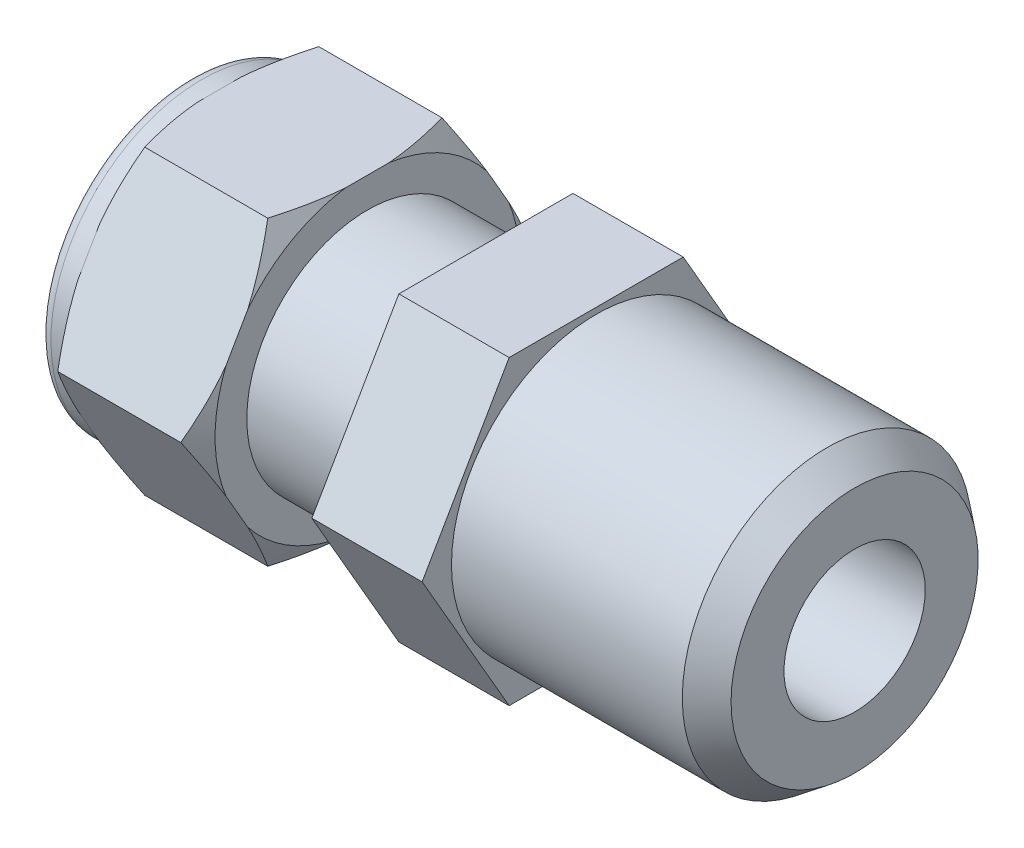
ISO-10303-21;
HEADER;
FILE_DESCRIPTION(('STEP AP214'),'2;1');
FILE_NAME('part.step','',(''),(''),'','','');
FILE_SCHEMA(('AUTOMOTIVE_DESIGN { 1 0 10303 214 1 1 1 1 }'));
ENDSEC;
DATA;
#1=APPLICATION_CONTEXT('core data for automotive mechanical design processes');
#2=APPLICATION_PROTOCOL_DEFINITION('international standard','automotive_design',2000,#1);
#3=PRODUCT_CONTEXT('',#1,'mechanical');
#4=PRODUCT('Part','Part','',(#3));
#5=PRODUCT_RELATED_PRODUCT_CATEGORY('part','',(#4));
#6=PRODUCT_DEFINITION_FORMATION('','',#4);
#7=PRODUCT_DEFINITION_CONTEXT('part definition',#1,'design');
#8=PRODUCT_DEFINITION('design','',#6,#7);
#9=PRODUCT_DEFINITION_SHAPE('','',#8);
#10=(LENGTH_UNIT() NAMED_UNIT(*) SI_UNIT(.MILLI.,.METRE.));
#11=(NAMED_UNIT(*) PLANE_ANGLE_UNIT() SI_UNIT($,.RADIAN.));
#12=(NAMED_UNIT(*) SI_UNIT($,.STERADIAN.) SOLID_ANGLE_UNIT());
#13=UNCERTAINTY_MEASURE_WITH_UNIT(LENGTH_MEASURE(1.E-05),#10,'distance_accuracy_value','');
#14=(GEOMETRIC_REPRESENTATION_CONTEXT(3) GLOBAL_UNCERTAINTY_ASSIGNED_CONTEXT((#13)) GLOBAL_UNIT_ASSIGNED_CONTEXT((#10,
#11,#12)) REPRESENTATION_CONTEXT('',''));
#15=CARTESIAN_POINT('',(0.,0.,0.));
#16=DIRECTION('',(0.,0.,1.));
#17=DIRECTION('',(1.,0.,0.));
#18=AXIS2_PLACEMENT_3D('',#15,#16,#17);
#19=CARTESIAN_POINT('',(-49.022,0.,0.));
#20=DIRECTION('',(1.,0.,0.));
#21=DIRECTION('',(0.,0.,-1.));
#22=AXIS2_PLACEMENT_3D('',#19,#20,#21);
#23=PLANE('',#22);
#24=CARTESIAN_POINT('',(-49.022,0.,0.));
#25=DIRECTION('',(1.,0.,0.));
#26=DIRECTION('',(0.,0.,-1.));
#27=AXIS2_PLACEMENT_3D('',#24,#25,#26);
#28=CIRCLE('',#27,10.2235);
#29=CARTESIAN_POINT('',(-49.022,0.,-10.2235));
#30=VERTEX_POINT('',#29);
#31=EDGE_CURVE('E431',#30,#30,#28,.F.);
#32=ORIENTED_EDGE('',*,*,#31,.T.);
#33=EDGE_LOOP('',(#32));
#34=FACE_BOUND('',#33,.T.);
#35=CARTESIAN_POINT('',(-49.022,0.,0.));
#36=DIRECTION('',(1.,0.,0.));
#37=DIRECTION('',(0.,0.,-1.));
#38=AXIS2_PLACEMENT_3D('',#35,#36,#37);
#39=CIRCLE('',#38,6.35);
#40=CARTESIAN_POINT('',(-49.022,0.,-6.35));
#41=VERTEX_POINT('',#40);
#42=EDGE_CURVE('E244',#41,#41,#39,.T.);
#43=ORIENTED_EDGE('',*,*,#42,.T.);
#44=EDGE_LOOP('',(#43));
#45=FACE_BOUND('',#44,.T.);
#46=ADVANCED_FACE('F34',(#34,#45),#23,.F.);
#47=CARTESIAN_POINT('',(-35.9156,-11.1125,-6.41580486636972));
#48=DIRECTION('',(0.,0.5,0.866025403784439));
#49=DIRECTION('',(0.,-0.866025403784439,0.5));
#50=AXIS2_PLACEMENT_3D('',#47,#48,#49);
#51=PLANE('',#50);
#52=CARTESIAN_POINT('',(-40.3644672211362,-18.831689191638,-1.95912890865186));
#53=CARTESIAN_POINT('',(-40.176043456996,-18.4825253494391,-2.16071874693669));
#54=CARTESIAN_POINT('',(-39.9896517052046,-18.1325262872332,-2.3627907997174));
#55=CARTESIAN_POINT('',(-39.6218864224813,-17.4305055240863,-2.76810267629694));
#56=CARTESIAN_POINT('',(-39.4405135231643,-17.0784835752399,-2.97134264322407));
#57=CARTESIAN_POINT('',(-39.0832157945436,-16.371019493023,-3.37979722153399));
#58=CARTESIAN_POINT('',(-38.9073103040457,-16.015570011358,-3.58501607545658));
#59=CARTESIAN_POINT('',(-38.5628685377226,-15.3020089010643,-3.99699077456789));
#60=CARTESIAN_POINT('',(-38.3943320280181,-14.9438973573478,-4.20374657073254));
#61=CARTESIAN_POINT('',(-38.0620665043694,-14.2154315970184,-4.62432647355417));
#62=CARTESIAN_POINT('',(-37.8985690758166,-13.8449977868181,-4.83819653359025));
#63=CARTESIAN_POINT('',(-37.5832139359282,-13.1003943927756,-5.26809350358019));
#64=CARTESIAN_POINT('',(-37.4313567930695,-12.7262246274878,-5.48412051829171));
#65=CARTESIAN_POINT('',(-37.1421713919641,-11.9740617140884,-5.9183819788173));
#66=CARTESIAN_POINT('',(-37.0048291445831,-11.5960726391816,-6.13661407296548));
#67=CARTESIAN_POINT('',(-36.7478424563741,-10.8356566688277,-6.57564043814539));
#68=CARTESIAN_POINT('',(-36.6281957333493,-10.4532303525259,-6.79643437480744));
#69=CARTESIAN_POINT('',(-36.3694010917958,-9.53870279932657,-7.3244371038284));
#70=CARTESIAN_POINT('',(-36.2398776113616,-9.00447137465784,-7.63287576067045));
#71=CARTESIAN_POINT('',(-36.0841701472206,-8.1976595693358,-8.0986887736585));
#72=CARTESIAN_POINT('',(-36.038698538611,-7.92782456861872,-8.25447808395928));
#73=CARTESIAN_POINT('',(-35.9617501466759,-7.38663974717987,-8.56693128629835));
#74=CARTESIAN_POINT('',(-35.9302732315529,-7.11528994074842,-8.7235951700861));
#75=CARTESIAN_POINT('',(-35.8825002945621,-6.57475546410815,-9.03567289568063));
#76=CARTESIAN_POINT('',(-35.8660321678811,-6.30558226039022,-9.19108011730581));
#77=CARTESIAN_POINT('',(-35.8481429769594,-5.76685974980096,-9.50211170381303));
#78=CARTESIAN_POINT('',(-35.8467217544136,-5.49731044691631,-9.65773606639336));
#79=CARTESIAN_POINT('',(-35.8589714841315,-4.95847234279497,-9.96883439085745));
#80=CARTESIAN_POINT('',(-35.872642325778,-4.68918353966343,-10.1243083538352));
#81=CARTESIAN_POINT('',(-35.9146623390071,-4.15143782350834,-10.4347759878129));
#82=CARTESIAN_POINT('',(-35.9430137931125,-3.88298104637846,-10.5897695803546));
#83=CARTESIAN_POINT('',(-36.0265867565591,-3.24897745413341,-10.9558117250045));
#84=CARTESIAN_POINT('',(-36.0878549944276,-2.88402385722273,-11.1665177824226));
#85=CARTESIAN_POINT('',(-36.2335162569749,-2.1576048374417,-11.5859159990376));
#86=CARTESIAN_POINT('',(-36.3179126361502,-1.79613992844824,-11.7946078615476));
#87=CARTESIAN_POINT('',(-36.506644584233,-1.07674438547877,-12.2099510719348));
#88=CARTESIAN_POINT('',(-36.6110026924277,-0.718818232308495,-12.4165998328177));
#89=CARTESIAN_POINT('',(-36.8363699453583,-0.00698201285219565,-12.8275786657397));
#90=CARTESIAN_POINT('',(-36.9573780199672,0.34692830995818,-13.0319088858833));
#91=CARTESIAN_POINT('',(-37.2146950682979,1.05517458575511,-13.4408150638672));
#92=CARTESIAN_POINT('',(-37.3511695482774,1.40946512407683,-13.6453648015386));
#93=CARTESIAN_POINT('',(-37.6355933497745,2.11429255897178,-14.0522971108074));
#94=CARTESIAN_POINT('',(-37.7835350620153,2.46483177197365,-14.2546810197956));
#95=CARTESIAN_POINT('',(-38.0888511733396,3.16269445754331,-14.6575922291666));
#96=CARTESIAN_POINT('',(-38.2462230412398,3.51001876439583,-14.858120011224));
#97=CARTESIAN_POINT('',(-38.56877442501,4.20198312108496,-15.2576258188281));
#98=CARTESIAN_POINT('',(-38.7339549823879,4.54662280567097,-15.4566036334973));
#99=CARTESIAN_POINT('',(-39.0195576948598,5.12910629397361,-15.7929006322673));
#100=CARTESIAN_POINT('',(-39.1383196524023,5.36756319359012,-15.930573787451));
#101=CARTESIAN_POINT('',(-39.3785868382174,5.84342856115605,-16.2053147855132));
#102=CARTESIAN_POINT('',(-39.500091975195,6.08083706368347,-16.3423826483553));
#103=CARTESIAN_POINT('',(-39.7442226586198,6.552206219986,-16.6145277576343));
#104=CARTESIAN_POINT('',(-39.8668227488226,6.78617677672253,-16.7496107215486));
#105=CARTESIAN_POINT('',(-40.1141304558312,7.25328632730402,-17.0192965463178));
#106=CARTESIAN_POINT('',(-40.238838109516,7.48642530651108,-17.1538993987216));
#107=CARTESIAN_POINT('',(-40.3644672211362,7.71918919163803,-17.2882856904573));
#108=B_SPLINE_CURVE_WITH_KNOTS('',3,(#52,#53,#54,#55,#56,#57,#58,#59,#60,#61,#62,#63,#64,#65,
#66,#67,#68,#69,#70,#71,#72,#73,#74,#75,#76,#77,#78,#79,#80,#81,#82,#83,#84,#85,#86,#87,#88,#89,
#90,#91,#92,#93,#94,#95,#96,#97,#98,#99,#100,#101,#102,#103,#104,#105,#106,#107),.UNSPECIFIED.,
.F.,.F.,(4,2,2,2,2,2,2,2,2,2,2,2,2,2,2,2,2,2,2,2,2,2,2,2,2,2,2,4),(0.,1.33512337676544,
2.67041401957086,4.0099872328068,5.34951789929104,6.72314693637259,8.09684301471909,
9.46920284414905,10.8413855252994,12.730320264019,13.6746972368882,14.6190653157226,
15.5524629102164,16.4858506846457,17.4192316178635,18.3527577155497,19.6295133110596,
20.906454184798,22.1848454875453,23.463154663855,24.7567335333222,26.049461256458,
27.3418435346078,28.6343986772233,29.5339839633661,30.4335393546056,31.323577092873,
32.2136304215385),.UNSPECIFIED.);
#109=CARTESIAN_POINT('',(-36.8416416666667,-11.1125,-6.41580486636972));
#110=VERTEX_POINT('',#109);
#111=CARTESIAN_POINT('',(-35.9156,-6.94531250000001,-8.82173169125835));
#112=VERTEX_POINT('',#111);
#113=EDGE_CURVE('E285',#110,#112,#108,.T.);
#114=ORIENTED_EDGE('',*,*,#113,.F.);
#115=DIRECTION('',(-1.,0.,0.));
#116=VECTOR('',#115,1.);
#117=CARTESIAN_POINT('',(-35.9156,-11.1125,-6.41580486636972));
#118=LINE('',#117,#116);
#119=CARTESIAN_POINT('',(-45.9115583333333,-11.1125,-6.41580486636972));
#120=VERTEX_POINT('',#119);
#121=EDGE_CURVE('E402',#110,#120,#118,.T.);
#122=ORIENTED_EDGE('',*,*,#121,.T.);
#123=CARTESIAN_POINT('',(-42.3887327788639,7.71918919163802,-17.2882856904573));
#124=CARTESIAN_POINT('',(-42.5771565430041,7.37002534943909,-17.0866958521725));
#125=CARTESIAN_POINT('',(-42.7635482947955,7.02002628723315,-16.8846237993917));
#126=CARTESIAN_POINT('',(-43.1313135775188,6.3180055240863,-16.4793119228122));
#127=CARTESIAN_POINT('',(-43.3126864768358,5.96598357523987,-16.2760719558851));
#128=CARTESIAN_POINT('',(-43.6699842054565,5.25851949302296,-15.8676173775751));
#129=CARTESIAN_POINT('',(-43.8458896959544,4.90307001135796,-15.6623985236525));
#130=CARTESIAN_POINT('',(-44.1903314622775,4.18950890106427,-15.2504238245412));
#131=CARTESIAN_POINT('',(-44.358867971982,3.83139735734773,-15.0436680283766));
#132=CARTESIAN_POINT('',(-44.6911334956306,3.10293159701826,-14.6230881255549));
#133=CARTESIAN_POINT('',(-44.8546309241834,2.73249778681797,-14.4092180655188));
#134=CARTESIAN_POINT('',(-45.1699860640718,1.98789439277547,-13.9793210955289));
#135=CARTESIAN_POINT('',(-45.3218432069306,1.61372462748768,-13.7632940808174));
#136=CARTESIAN_POINT('',(-45.611028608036,0.861561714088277,-13.3290326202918));
#137=CARTESIAN_POINT('',(-45.748370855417,0.483572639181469,-13.1108005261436));
#138=CARTESIAN_POINT('',(-46.0053575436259,-0.276843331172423,-12.6717741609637));
#139=CARTESIAN_POINT('',(-46.1250042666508,-0.65926964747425,-12.4509802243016));
#140=CARTESIAN_POINT('',(-46.3837989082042,-1.5737972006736,-11.9229774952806));
#141=CARTESIAN_POINT('',(-46.5133223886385,-2.10802862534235,-11.6145388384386));
#142=CARTESIAN_POINT('',(-46.6690298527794,-2.91484043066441,-11.1487258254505));
#143=CARTESIAN_POINT('',(-46.714501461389,-3.18467543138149,-10.9929365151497));
#144=CARTESIAN_POINT('',(-46.7914498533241,-3.72586025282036,-10.6804833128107));
#145=CARTESIAN_POINT('',(-46.8229267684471,-3.99721005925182,-10.5238194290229));
#146=CARTESIAN_POINT('',(-46.8706997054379,-4.5377445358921,-10.2117417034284));
#147=CARTESIAN_POINT('',(-46.8871678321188,-4.80691773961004,-10.0563344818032));
#148=CARTESIAN_POINT('',(-46.9050570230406,-5.34564025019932,-9.74530289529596));
#149=CARTESIAN_POINT('',(-46.9064782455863,-5.61518955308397,-9.58967853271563));
#150=CARTESIAN_POINT('',(-46.8942285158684,-6.15402765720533,-9.27858020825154));
#151=CARTESIAN_POINT('',(-46.8805576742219,-6.42331646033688,-9.12310624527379));
#152=CARTESIAN_POINT('',(-46.8385376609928,-6.96106217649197,-8.81263861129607));
#153=CARTESIAN_POINT('',(-46.8101862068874,-7.22951895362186,-8.65764501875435));
#154=CARTESIAN_POINT('',(-46.7266132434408,-7.86352254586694,-8.29160287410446));
#155=CARTESIAN_POINT('',(-46.6653450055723,-8.22847614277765,-8.08089681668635));
#156=CARTESIAN_POINT('',(-46.519683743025,-8.95489516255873,-7.66149860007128));
#157=CARTESIAN_POINT('',(-46.4352873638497,-9.31636007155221,-7.45280673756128));
#158=CARTESIAN_POINT('',(-46.2465554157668,-10.0357556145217,-7.03746352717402));
#159=CARTESIAN_POINT('',(-46.1421973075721,-10.393681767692,-6.83081476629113));
#160=CARTESIAN_POINT('',(-45.9168300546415,-11.1055179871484,-6.41983593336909));
#161=CARTESIAN_POINT('',(-45.7958219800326,-11.4594283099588,-6.21550571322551));
#162=CARTESIAN_POINT('',(-45.5385049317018,-12.1676745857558,-5.80659953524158));
#163=CARTESIAN_POINT('',(-45.4020304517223,-12.5219651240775,-5.60204979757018));
#164=CARTESIAN_POINT('',(-45.1176066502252,-13.2267925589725,-5.19511748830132));
#165=CARTESIAN_POINT('',(-44.9696649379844,-13.5773317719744,-4.99273357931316));
#166=CARTESIAN_POINT('',(-44.66434882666,-14.2751944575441,-4.58982236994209));
#167=CARTESIAN_POINT('',(-44.5069769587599,-14.6225187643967,-4.38929458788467));
#168=CARTESIAN_POINT('',(-44.1844255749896,-15.3144831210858,-3.98978878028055));
#169=CARTESIAN_POINT('',(-44.0192450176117,-15.6591228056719,-3.79081096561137));
#170=CARTESIAN_POINT('',(-43.7336423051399,-16.2416062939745,-3.45451396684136));
#171=CARTESIAN_POINT('',(-43.6148803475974,-16.4800631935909,-3.31684081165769));
#172=CARTESIAN_POINT('',(-43.3746131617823,-16.9559285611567,-3.04209981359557));
#173=CARTESIAN_POINT('',(-43.2531080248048,-17.193337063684,-2.90503195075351));
#174=CARTESIAN_POINT('',(-43.0089773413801,-17.6647062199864,-2.63288684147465));
#175=CARTESIAN_POINT('',(-42.8863772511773,-17.8986767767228,-2.49780387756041));
#176=CARTESIAN_POINT('',(-42.6390695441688,-18.3657863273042,-2.22811805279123));
#177=CARTESIAN_POINT('',(-42.514361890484,-18.5989253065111,-2.09351520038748));
#178=CARTESIAN_POINT('',(-42.3887327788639,-18.831689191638,-1.95912890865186));
#179=B_SPLINE_CURVE_WITH_KNOTS('',3,(#123,#124,#125,#126,#127,#128,#129,#130,#131,#132,#133,
#134,#135,#136,#137,#138,#139,#140,#141,#142,#143,#144,#145,#146,#147,#148,#149,#150,#151,#152,
#153,#154,#155,#156,#157,#158,#159,#160,#161,#162,#163,#164,#165,#166,#167,#168,#169,#170,#171,
#172,#173,#174,#175,#176,#177,#178),.UNSPECIFIED.,.F.,.F.,(4,2,2,2,2,2,2,2,2,2,2,2,2,2,2,2,2,2,
2,2,2,2,2,2,2,2,2,4),(0.,1.33512337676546,2.6704140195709,4.00998723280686,5.34951789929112,
6.72314693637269,8.09684301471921,9.46920284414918,10.8413855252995,12.7303202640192,
13.6746972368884,14.6190653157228,15.5524629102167,16.485850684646,17.4192316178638,
18.35275771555,19.62951331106,20.9064541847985,22.1848454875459,23.4631546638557,
24.756733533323,26.0494612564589,27.3418435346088,28.6343986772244,29.5339839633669,
30.4335393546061,31.3235770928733,32.2136304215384),.UNSPECIFIED.);
#180=CARTESIAN_POINT('',(-46.8376,-6.94531249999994,-8.82173169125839));
#181=VERTEX_POINT('',#180);
#182=EDGE_CURVE('E456',#181,#120,#179,.T.);
#183=ORIENTED_EDGE('',*,*,#182,.F.);
#184=DIRECTION('',(0.,0.866025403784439,-0.5));
#185=VECTOR('',#184,1.);
#186=CARTESIAN_POINT('',(-46.8376,-11.1125,-6.41580486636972));
#187=LINE('',#186,#185);
#188=CARTESIAN_POINT('',(-46.8376,-5.55625,-9.62370729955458));
#189=VERTEX_POINT('',#188);
#190=EDGE_CURVE('E366',#181,#189,#187,.T.);
#191=ORIENTED_EDGE('',*,*,#190,.T.);
#192=CARTESIAN_POINT('',(-46.8376,-4.16718750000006,-10.4256829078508));
#193=VERTEX_POINT('',#192);
#194=EDGE_CURVE('E369',#189,#193,#187,.T.);
#195=ORIENTED_EDGE('',*,*,#194,.T.);
#196=CARTESIAN_POINT('',(-45.9115583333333,0.,-12.8316097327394));
#197=VERTEX_POINT('',#196);
#198=EDGE_CURVE('E528',#197,#193,#179,.T.);
#199=ORIENTED_EDGE('',*,*,#198,.F.);
#200=DIRECTION('',(-1.,0.,0.));
#201=VECTOR('',#200,1.);
#202=CARTESIAN_POINT('',(-35.9156,0.,-12.8316097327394));
#203=LINE('',#202,#201);
#204=CARTESIAN_POINT('',(-36.8416416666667,0.,-12.8316097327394));
#205=VERTEX_POINT('',#204);
#206=EDGE_CURVE('E412',#205,#197,#203,.T.);
#207=ORIENTED_EDGE('',*,*,#206,.F.);
#208=CARTESIAN_POINT('',(-35.9156,-4.16718749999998,-10.4256829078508));
#209=VERTEX_POINT('',#208);
#210=EDGE_CURVE('E943',#209,#205,#108,.T.);
#211=ORIENTED_EDGE('',*,*,#210,.F.);
#212=DIRECTION('',(0.,0.866025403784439,-0.5));
#213=VECTOR('',#212,1.);
#214=CARTESIAN_POINT('',(-35.9156,-11.1125,-6.41580486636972));
#215=LINE('',#214,#213);
#216=EDGE_CURVE('E384',#112,#209,#215,.T.);
#217=ORIENTED_EDGE('',*,*,#216,.F.);
#218=EDGE_LOOP('',(#114,#122,#183,#191,#195,#199,#207,#211,#217));
#219=FACE_BOUND('',#218,.T.);
#220=ADVANCED_FACE('F555',(#219),#51,.F.);
#221=CARTESIAN_POINT('',(-35.9156,0.,-12.8316097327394));
#222=DIRECTION('',(0.,-0.5,0.866025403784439));
#223=DIRECTION('',(0.,-0.866025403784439,-0.5));
#224=AXIS2_PLACEMENT_3D('',#221,#222,#223);
#225=PLANE('',#224);
#226=CARTESIAN_POINT('',(-40.3644672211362,-7.71918919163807,-17.2882856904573));
#227=CARTESIAN_POINT('',(-40.176043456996,-7.37002534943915,-17.0866958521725));
#228=CARTESIAN_POINT('',(-39.9896517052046,-7.02002628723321,-16.8846237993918));
#229=CARTESIAN_POINT('',(-39.6218864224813,-6.31800552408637,-16.4793119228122));
#230=CARTESIAN_POINT('',(-39.4405135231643,-5.96598357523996,-16.2760719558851));
#231=CARTESIAN_POINT('',(-39.0832157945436,-5.25851949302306,-15.8676173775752));
#232=CARTESIAN_POINT('',(-38.9073103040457,-4.90307001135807,-15.6623985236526));
#233=CARTESIAN_POINT('',(-38.5628685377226,-4.18950890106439,-15.2504238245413));
#234=CARTESIAN_POINT('',(-38.3943320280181,-3.83139735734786,-15.0436680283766));
#235=CARTESIAN_POINT('',(-38.0620665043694,-3.10293159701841,-14.623088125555));
#236=CARTESIAN_POINT('',(-37.8985690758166,-2.73249778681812,-14.4092180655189));
#237=CARTESIAN_POINT('',(-37.5832139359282,-1.98789439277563,-13.979321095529));
#238=CARTESIAN_POINT('',(-37.4313567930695,-1.61372462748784,-13.7632940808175));
#239=CARTESIAN_POINT('',(-37.1421713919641,-0.861561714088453,-13.3290326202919));
#240=CARTESIAN_POINT('',(-37.0048291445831,-0.483572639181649,-13.1108005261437));
#241=CARTESIAN_POINT('',(-36.7478424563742,0.276843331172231,-12.6717741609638));
#242=CARTESIAN_POINT('',(-36.6281957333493,0.659269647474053,-12.4509802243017));
#243=CARTESIAN_POINT('',(-36.3694010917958,1.57379720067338,-11.9229774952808));
#244=CARTESIAN_POINT('',(-36.2398776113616,2.10802862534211,-11.6145388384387));
#245=CARTESIAN_POINT('',(-36.0841701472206,2.91484043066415,-11.1487258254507));
#246=CARTESIAN_POINT('',(-36.038698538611,3.18467543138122,-10.9929365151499));
#247=CARTESIAN_POINT('',(-35.9617501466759,3.72586025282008,-10.6804833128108));
#248=CARTESIAN_POINT('',(-35.9302732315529,3.99721005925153,-10.5238194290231));
#249=CARTESIAN_POINT('',(-35.882500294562,4.5377445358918,-10.2117417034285));
#250=CARTESIAN_POINT('',(-35.8660321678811,4.80691773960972,-10.0563344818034));
#251=CARTESIAN_POINT('',(-35.8481429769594,5.34564025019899,-9.74530289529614));
#252=CARTESIAN_POINT('',(-35.8467217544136,5.61518955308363,-9.58967853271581));
#253=CARTESIAN_POINT('',(-35.8589714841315,6.15402765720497,-9.27858020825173));
#254=CARTESIAN_POINT('',(-35.872642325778,6.42331646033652,-9.12310624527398));
#255=CARTESIAN_POINT('',(-35.9146623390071,6.9610621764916,-8.81263861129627));
#256=CARTESIAN_POINT('',(-35.9430137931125,7.22951895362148,-8.65764501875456));
#257=CARTESIAN_POINT('',(-36.0265867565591,7.86352254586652,-8.29160287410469));
#258=CARTESIAN_POINT('',(-36.0878549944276,8.2284761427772,-8.08089681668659));
#259=CARTESIAN_POINT('',(-36.2335162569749,8.95489516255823,-7.66149860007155));
#260=CARTESIAN_POINT('',(-36.3179126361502,9.31636007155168,-7.45280673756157));
#261=CARTESIAN_POINT('',(-36.506644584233,10.0357556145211,-7.03746352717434));
#262=CARTESIAN_POINT('',(-36.6110026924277,10.3936817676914,-6.83081476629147));
#263=CARTESIAN_POINT('',(-36.8363699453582,11.1055179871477,-6.41983593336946));
#264=CARTESIAN_POINT('',(-36.9573780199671,11.4594283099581,-6.2155057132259));
#265=CARTESIAN_POINT('',(-37.2146950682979,12.167674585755,-5.806599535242));
#266=CARTESIAN_POINT('',(-37.3511695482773,12.5219651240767,-5.60204979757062));
#267=CARTESIAN_POINT('',(-37.6355933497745,13.2267925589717,-5.19511748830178));
#268=CARTESIAN_POINT('',(-37.7835350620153,13.5773317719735,-4.99273357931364));
#269=CARTESIAN_POINT('',(-38.0888511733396,14.2751944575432,-4.5898223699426));
#270=CARTESIAN_POINT('',(-38.2462230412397,14.6225187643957,-4.3892945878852));
#271=CARTESIAN_POINT('',(-38.56877442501,15.3144831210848,-3.98978878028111));
#272=CARTESIAN_POINT('',(-38.7339549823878,15.6591228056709,-3.79081096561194));
#273=CARTESIAN_POINT('',(-39.0195576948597,16.2416062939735,-3.4545139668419));
#274=CARTESIAN_POINT('',(-39.1383196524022,16.48006319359,-3.31684081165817));
#275=CARTESIAN_POINT('',(-39.3785868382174,16.955928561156,-3.04209981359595));
#276=CARTESIAN_POINT('',(-39.5000919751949,17.1933370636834,-2.90503195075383));
#277=CARTESIAN_POINT('',(-39.7442226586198,17.664706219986,-2.63288684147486));
#278=CARTESIAN_POINT('',(-39.8668227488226,17.8986767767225,-2.49780387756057));
#279=CARTESIAN_POINT('',(-40.1141304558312,18.365786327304,-2.22811805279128));
#280=CARTESIAN_POINT('',(-40.238838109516,18.5989253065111,-2.09351520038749));
#281=CARTESIAN_POINT('',(-40.3644672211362,18.8316891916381,-1.95912890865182));
#282=B_SPLINE_CURVE_WITH_KNOTS('',3,(#226,#227,#228,#229,#230,#231,#232,#233,#234,#235,#236,
#237,#238,#239,#240,#241,#242,#243,#244,#245,#246,#247,#248,#249,#250,#251,#252,#253,#254,#255,
#256,#257,#258,#259,#260,#261,#262,#263,#264,#265,#266,#267,#268,#269,#270,#271,#272,#273,#274,
#275,#276,#277,#278,#279,#280,#281),.UNSPECIFIED.,.F.,.F.,(4,2,2,2,2,2,2,2,2,2,2,2,2,2,2,2,2,2,
2,2,2,2,2,2,2,2,2,4),(0.,1.33512337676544,2.67041401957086,4.0099872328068,5.34951789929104,
6.72314693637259,8.0968430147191,9.46920284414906,10.8413855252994,12.730320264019,
13.6746972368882,14.6190653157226,15.5524629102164,16.4858506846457,17.4192316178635,
18.3527577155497,19.6295133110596,20.9064541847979,22.1848454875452,23.4631546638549,
24.7567335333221,26.0494612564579,27.3418435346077,28.6343986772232,29.5339839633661,
30.4335393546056,31.3235770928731,32.2136304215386),.UNSPECIFIED.);
#283=CARTESIAN_POINT('',(-35.9156,4.1671874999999,-10.4256829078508));
#284=VERTEX_POINT('',#283);
#285=EDGE_CURVE('E937',#205,#284,#282,.T.);
#286=ORIENTED_EDGE('',*,*,#285,.F.);
#287=ORIENTED_EDGE('',*,*,#206,.T.);
#288=CARTESIAN_POINT('',(-42.3887327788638,18.8316891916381,-1.95912890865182));
#289=CARTESIAN_POINT('',(-42.5771565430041,18.4825253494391,-2.16071874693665));
#290=CARTESIAN_POINT('',(-42.7635482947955,18.1325262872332,-2.36279079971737));
#291=CARTESIAN_POINT('',(-43.1313135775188,17.4305055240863,-2.76810267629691));
#292=CARTESIAN_POINT('',(-43.3126864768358,17.0784835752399,-2.97134264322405));
#293=CARTESIAN_POINT('',(-43.6699842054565,16.371019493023,-3.37979722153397));
#294=CARTESIAN_POINT('',(-43.8458896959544,16.015570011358,-3.58501607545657));
#295=CARTESIAN_POINT('',(-44.1903314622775,15.3020089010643,-3.99699077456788));
#296=CARTESIAN_POINT('',(-44.358867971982,14.9438973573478,-4.20374657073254));
#297=CARTESIAN_POINT('',(-44.6911334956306,14.2154315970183,-4.62432647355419));
#298=CARTESIAN_POINT('',(-44.8546309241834,13.844997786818,-4.83819653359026));
#299=CARTESIAN_POINT('',(-45.1699860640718,13.1003943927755,-5.26809350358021));
#300=CARTESIAN_POINT('',(-45.3218432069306,12.7262246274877,-5.48412051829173));
#301=CARTESIAN_POINT('',(-45.611028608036,11.9740617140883,-5.91838197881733));
#302=CARTESIAN_POINT('',(-45.748370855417,11.5960726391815,-6.13661407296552));
#303=CARTESIAN_POINT('',(-46.0053575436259,10.8356566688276,-6.57564043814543));
#304=CARTESIAN_POINT('',(-46.1250042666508,10.4532303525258,-6.79643437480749));
#305=CARTESIAN_POINT('',(-46.3837989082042,9.53870279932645,-7.32443710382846));
#306=CARTESIAN_POINT('',(-46.5133223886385,9.0044713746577,-7.63287576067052));
#307=CARTESIAN_POINT('',(-46.6690298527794,8.19765956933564,-8.09868877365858));
#308=CARTESIAN_POINT('',(-46.714501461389,7.92782456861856,-8.25447808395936));
#309=CARTESIAN_POINT('',(-46.7914498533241,7.38663974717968,-8.56693128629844));
#310=CARTESIAN_POINT('',(-46.8229267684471,7.11528994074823,-8.72359517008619));
#311=CARTESIAN_POINT('',(-46.8706997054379,6.57475546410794,-9.03567289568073));
#312=CARTESIAN_POINT('',(-46.8871678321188,6.30558226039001,-9.19108011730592));
#313=CARTESIAN_POINT('',(-46.9050570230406,5.76685974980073,-9.50211170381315));
#314=CARTESIAN_POINT('',(-46.9064782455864,5.49731044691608,-9.65773606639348));
#315=CARTESIAN_POINT('',(-46.8942285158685,4.95847234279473,-9.96883439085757));
#316=CARTESIAN_POINT('',(-46.8805576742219,4.68918353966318,-10.1243083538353));
#317=CARTESIAN_POINT('',(-46.8385376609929,4.15143782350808,-10.434775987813));
#318=CARTESIAN_POINT('',(-46.8101862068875,3.88298104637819,-10.5897695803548));
#319=CARTESIAN_POINT('',(-46.7266132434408,3.24897745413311,-10.9558117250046));
#320=CARTESIAN_POINT('',(-46.6653450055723,2.88402385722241,-11.1665177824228));
#321=CARTESIAN_POINT('',(-46.519683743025,2.15760483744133,-11.5859159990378));
#322=CARTESIAN_POINT('',(-46.4352873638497,1.79613992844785,-11.7946078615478));
#323=CARTESIAN_POINT('',(-46.2465554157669,1.07674438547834,-12.2099510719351));
#324=CARTESIAN_POINT('',(-46.1421973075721,0.718818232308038,-12.416599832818));
#325=CARTESIAN_POINT('',(-45.9168300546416,0.00698201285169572,-12.82757866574));
#326=CARTESIAN_POINT('',(-45.7958219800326,-0.346928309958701,-13.0319088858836));
#327=CARTESIAN_POINT('',(-45.5385049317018,-1.05517458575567,-13.4408150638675));
#328=CARTESIAN_POINT('',(-45.4020304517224,-1.40946512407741,-13.6453648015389));
#329=CARTESIAN_POINT('',(-45.1176066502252,-2.11429255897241,-14.0522971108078));
#330=CARTESIAN_POINT('',(-44.9696649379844,-2.4648317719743,-14.2546810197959));
#331=CARTESIAN_POINT('',(-44.6643488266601,-3.162694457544,-14.657592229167));
#332=CARTESIAN_POINT('',(-44.5069769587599,-3.51001876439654,-14.8581200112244));
#333=CARTESIAN_POINT('',(-44.1844255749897,-4.20198312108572,-15.2576258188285));
#334=CARTESIAN_POINT('',(-44.0192450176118,-4.54662280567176,-15.4566036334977));
#335=CARTESIAN_POINT('',(-43.7336423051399,-5.12910629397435,-15.7929006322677));
#336=CARTESIAN_POINT('',(-43.6148803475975,-5.3675631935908,-15.9305737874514));
#337=CARTESIAN_POINT('',(-43.3746131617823,-5.8434285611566,-16.2053147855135));
#338=CARTESIAN_POINT('',(-43.2531080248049,-6.08083706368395,-16.3423826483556));
#339=CARTESIAN_POINT('',(-43.0089773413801,-6.55220621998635,-16.6145277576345));
#340=CARTESIAN_POINT('',(-42.8863772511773,-6.78617677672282,-16.7496107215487));
#341=CARTESIAN_POINT('',(-42.6390695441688,-7.25328632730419,-17.0192965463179));
#342=CARTESIAN_POINT('',(-42.514361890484,-7.48642530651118,-17.1538993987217));
#343=CARTESIAN_POINT('',(-42.3887327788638,-7.71918919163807,-17.2882856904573));
#344=B_SPLINE_CURVE_WITH_KNOTS('',3,(#288,#289,#290,#291,#292,#293,#294,#295,#296,#297,#298,
#299,#300,#301,#302,#303,#304,#305,#306,#307,#308,#309,#310,#311,#312,#313,#314,#315,#316,#317,
#318,#319,#320,#321,#322,#323,#324,#325,#326,#327,#328,#329,#330,#331,#332,#333,#334,#335,#336,
#337,#338,#339,#340,#341,#342,#343),.UNSPECIFIED.,.F.,.F.,(4,2,2,2,2,2,2,2,2,2,2,2,2,2,2,2,2,2,
2,2,2,2,2,2,2,2,2,4),(0.,1.33512337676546,2.6704140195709,4.00998723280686,5.34951789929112,
6.72314693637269,8.09684301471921,9.46920284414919,10.8413855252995,12.7303202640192,
13.6746972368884,14.6190653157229,15.5524629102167,16.485850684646,17.4192316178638,
18.35275771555,19.62951331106,20.9064541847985,22.1848454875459,23.4631546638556,
24.756733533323,26.0494612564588,27.3418435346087,28.6343986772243,29.5339839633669,
30.4335393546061,31.3235770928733,32.2136304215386),.UNSPECIFIED.);
#345=CARTESIAN_POINT('',(-46.8376,4.1671875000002,-10.4256829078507));
#346=VERTEX_POINT('',#345);
#347=EDGE_CURVE('E365',#346,#197,#344,.T.);
#348=ORIENTED_EDGE('',*,*,#347,.F.);
#349=DIRECTION('',(0.,0.866025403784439,0.5));
#350=VECTOR('',#349,1.);
#351=CARTESIAN_POINT('',(-46.8376,0.,-12.8316097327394));
#352=LINE('',#351,#350);
#353=CARTESIAN_POINT('',(-46.8376,5.55624999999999,-9.62370729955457));
#354=VERTEX_POINT('',#353);
#355=EDGE_CURVE('E370',#346,#354,#352,.T.);
#356=ORIENTED_EDGE('',*,*,#355,.T.);
#357=CARTESIAN_POINT('',(-46.8376,6.9453125,-8.82173169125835));
#358=VERTEX_POINT('',#357);
#359=EDGE_CURVE('E368',#354,#358,#352,.T.);
#360=ORIENTED_EDGE('',*,*,#359,.T.);
#361=CARTESIAN_POINT('',(-45.9115583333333,11.1125,-6.41580486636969));
#362=VERTEX_POINT('',#361);
#363=EDGE_CURVE('E360',#362,#358,#344,.T.);
#364=ORIENTED_EDGE('',*,*,#363,.F.);
#365=DIRECTION('',(-1.,0.,0.));
#366=VECTOR('',#365,1.);
#367=CARTESIAN_POINT('',(-35.9156,11.1125,-6.4158048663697));
#368=LINE('',#367,#366);
#369=CARTESIAN_POINT('',(-36.8416416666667,11.1125,-6.41580486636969));
#370=VERTEX_POINT('',#369);
#371=EDGE_CURVE('E410',#370,#362,#368,.T.);
#372=ORIENTED_EDGE('',*,*,#371,.F.);
#373=CARTESIAN_POINT('',(-35.9156,6.94531250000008,-8.82173169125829));
#374=VERTEX_POINT('',#373);
#375=EDGE_CURVE('E331',#374,#370,#282,.T.);
#376=ORIENTED_EDGE('',*,*,#375,.F.);
#377=DIRECTION('',(0.,0.866025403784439,0.5));
#378=VECTOR('',#377,1.);
#379=CARTESIAN_POINT('',(-35.9156,0.,-12.8316097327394));
#380=LINE('',#379,#378);
#381=EDGE_CURVE('E387',#284,#374,#380,.T.);
#382=ORIENTED_EDGE('',*,*,#381,.F.);
#383=EDGE_LOOP('',(#286,#287,#348,#356,#360,#364,#372,#376,#382));
#384=FACE_BOUND('',#383,.T.);
#385=ADVANCED_FACE('F341',(#384),#225,.F.);
#386=CARTESIAN_POINT('',(-35.9156,11.1125,-6.4158048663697));
#387=DIRECTION('',(0.,-1.,0.));
#388=DIRECTION('',(0.,0.,-1.));
#389=AXIS2_PLACEMENT_3D('',#386,#387,#388);
#390=PLANE('',#389);
#391=CARTESIAN_POINT('',(-39.8141514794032,11.1125,-14.1349940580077));
#392=CARTESIAN_POINT('',(-39.6319745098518,11.1125,-13.7335106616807));
#393=CARTESIAN_POINT('',(-39.4521709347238,11.1125,-13.3309294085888));
#394=CARTESIAN_POINT('',(-39.0984621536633,11.1125,-12.523100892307));
#395=CARTESIAN_POINT('',(-38.9245580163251,11.1125,-12.1178531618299));
#396=CARTESIAN_POINT('',(-38.5831551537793,11.1125,-11.3026679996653));
#397=CARTESIAN_POINT('',(-38.4156861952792,11.1125,-10.8927180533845));
#398=CARTESIAN_POINT('',(-38.0895157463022,11.1125,-10.0693535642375));
#399=CARTESIAN_POINT('',(-37.9308138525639,11.1125,-9.65593918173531));
#400=CARTESIAN_POINT('',(-37.6248132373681,11.1125,-8.82698763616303));
#401=CARTESIAN_POINT('',(-37.4774667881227,11.1125,-8.41146817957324));
#402=CARTESIAN_POINT('',(-37.1957876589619,11.1125,-7.5759884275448));
#403=CARTESIAN_POINT('',(-37.0614556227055,11.1125,-7.15602791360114));
#404=CARTESIAN_POINT('',(-36.8088799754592,11.1125,-6.31186429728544));
#405=CARTESIAN_POINT('',(-36.6906153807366,11.1125,-5.88766752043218));
#406=CARTESIAN_POINT('',(-36.4733369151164,11.1125,-5.03436495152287));
#407=CARTESIAN_POINT('',(-36.3743203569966,11.1125,-4.60525985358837));
#408=CARTESIAN_POINT('',(-36.2239478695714,11.1125,-3.86452260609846));
#409=CARTESIAN_POINT('',(-36.1670345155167,11.1125,-3.55401813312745));
#410=CARTESIAN_POINT('',(-36.0662647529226,11.1125,-2.93088636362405));
#411=CARTESIAN_POINT('',(-36.0224079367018,11.1125,-2.61825913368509));
#412=CARTESIAN_POINT('',(-35.9489105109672,11.1125,-1.99140478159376));
#413=CARTESIAN_POINT('',(-35.9192663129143,11.1125,-1.67717808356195));
#414=CARTESIAN_POINT('',(-35.8750383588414,11.1125,-1.04765704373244));
#415=CARTESIAN_POINT('',(-35.8604545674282,11.1125,-0.732362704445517));
#416=CARTESIAN_POINT('',(-35.8468022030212,11.1125,-0.101597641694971));
#417=CARTESIAN_POINT('',(-35.8477256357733,11.1125,0.213872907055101));
#418=CARTESIAN_POINT('',(-35.8650387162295,11.1125,0.844383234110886));
#419=CARTESIAN_POINT('',(-35.8814282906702,11.1125,1.15942301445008));
#420=CARTESIAN_POINT('',(-35.9291731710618,11.1125,1.7883901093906));
#421=CARTESIAN_POINT('',(-35.9605300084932,11.1125,2.10231730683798));
#422=CARTESIAN_POINT('',(-36.0373067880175,11.1125,2.72843846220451));
#423=CARTESIAN_POINT('',(-36.0827273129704,11.1125,3.04063234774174));
#424=CARTESIAN_POINT('',(-36.2124269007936,11.1125,3.81855070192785));
#425=CARTESIAN_POINT('',(-36.3047777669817,11.1125,4.28293564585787));
#426=CARTESIAN_POINT('',(-36.5140558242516,11.1125,5.20613419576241));
#427=CARTESIAN_POINT('',(-36.6309884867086,11.1125,5.66494653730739));
#428=CARTESIAN_POINT('',(-36.8852945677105,11.1125,6.57791063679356));
#429=CARTESIAN_POINT('',(-37.0227126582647,11.1125,7.03204983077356));
#430=CARTESIAN_POINT('',(-37.3139006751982,11.1125,7.93497277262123));
#431=CARTESIAN_POINT('',(-37.4676694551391,11.1125,8.38375689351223));
#432=CARTESIAN_POINT('',(-37.7901934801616,11.1125,9.28169678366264));
#433=CARTESIAN_POINT('',(-37.9591004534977,11.1125,9.73079771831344));
#434=CARTESIAN_POINT('',(-38.3077163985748,11.1125,10.6247979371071));
#435=CARTESIAN_POINT('',(-38.4874260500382,11.1125,11.069696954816));
#436=CARTESIAN_POINT('',(-38.8544023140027,11.1125,11.9531117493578));
#437=CARTESIAN_POINT('',(-39.0416149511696,11.1125,12.3916500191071));
#438=CARTESIAN_POINT('',(-39.3276544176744,11.1125,13.04710685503));
#439=CARTESIAN_POINT('',(-39.423859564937,11.1125,13.2651756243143));
#440=CARTESIAN_POINT('',(-39.6178556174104,11.1125,13.7006022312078));
#441=CARTESIAN_POINT('',(-39.7156464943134,11.1125,13.917960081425));
#442=CARTESIAN_POINT('',(-39.8141514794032,11.1125,14.1349940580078));
#443=B_SPLINE_CURVE_WITH_KNOTS('',3,(#391,#392,#393,#394,#395,#396,#397,#398,#399,#400,#401,
#402,#403,#404,#405,#406,#407,#408,#409,#410,#411,#412,#413,#414,#415,#416,#417,#418,#419,#420,
#421,#422,#423,#424,#425,#426,#427,#428,#429,#430,#431,#432,#433,#434,#435,#436,#437,#438,#439,
#440,#441,#442),.UNSPECIFIED.,.F.,.F.,(4,2,2,2,2,2,2,2,2,2,2,2,2,2,2,2,2,2,2,2,2,2,2,2,2,4),(0.,
1.32266815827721,2.64557463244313,3.97400303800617,5.30237028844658,6.62480949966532,
7.94731408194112,9.26807454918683,10.5886504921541,11.5354410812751,12.4822021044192,
13.4287239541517,14.3752435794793,15.3212752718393,16.2673024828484,17.2134265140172,
18.1595897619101,19.5791704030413,20.9990673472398,22.4221071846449,23.8450473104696,
25.2843164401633,26.7236762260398,28.1540804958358,28.8691172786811,29.5841413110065),.UNSPECIFIED.);
#444=CARTESIAN_POINT('',(-35.9156,11.1125,-1.6039512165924));
#445=VERTEX_POINT('',#444);
#446=EDGE_CURVE('E329',#370,#445,#443,.T.);
#447=ORIENTED_EDGE('',*,*,#446,.F.);
#448=ORIENTED_EDGE('',*,*,#371,.T.);
#449=CARTESIAN_POINT('',(-42.9390485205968,11.1125,14.1349940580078));
#450=CARTESIAN_POINT('',(-43.1212254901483,11.1125,13.7335106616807));
#451=CARTESIAN_POINT('',(-43.3010290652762,11.1125,13.3309294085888));
#452=CARTESIAN_POINT('',(-43.6547378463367,11.1125,12.523100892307));
#453=CARTESIAN_POINT('',(-43.8286419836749,11.1125,12.1178531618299));
#454=CARTESIAN_POINT('',(-44.1700448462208,11.1125,11.3026679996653));
#455=CARTESIAN_POINT('',(-44.3375138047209,11.1125,10.8927180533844));
#456=CARTESIAN_POINT('',(-44.6636842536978,11.1125,10.0693535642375));
#457=CARTESIAN_POINT('',(-44.8223861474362,11.1125,9.65593918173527));
#458=CARTESIAN_POINT('',(-45.1283867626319,11.1125,8.82698763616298));
#459=CARTESIAN_POINT('',(-45.2757332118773,11.1125,8.41146817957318));
#460=CARTESIAN_POINT('',(-45.5574123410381,11.1125,7.57598842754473));
#461=CARTESIAN_POINT('',(-45.6917443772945,11.1125,7.15602791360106));
#462=CARTESIAN_POINT('',(-45.9443200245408,11.1125,6.31186429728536));
#463=CARTESIAN_POINT('',(-46.0625846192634,11.1125,5.88766752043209));
#464=CARTESIAN_POINT('',(-46.2798630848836,11.1125,5.03436495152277));
#465=CARTESIAN_POINT('',(-46.3788796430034,11.1125,4.60525985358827));
#466=CARTESIAN_POINT('',(-46.5292521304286,11.1125,3.86452260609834));
#467=CARTESIAN_POINT('',(-46.5861654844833,11.1125,3.55401813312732));
#468=CARTESIAN_POINT('',(-46.6869352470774,11.1125,2.9308863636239));
#469=CARTESIAN_POINT('',(-46.7307920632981,11.1125,2.61825913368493));
#470=CARTESIAN_POINT('',(-46.8042894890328,11.1125,1.99140478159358));
#471=CARTESIAN_POINT('',(-46.8339336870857,11.1125,1.67717808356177));
#472=CARTESIAN_POINT('',(-46.8781616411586,11.1125,1.04765704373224));
#473=CARTESIAN_POINT('',(-46.8927454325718,11.1125,0.73236270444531));
#474=CARTESIAN_POINT('',(-46.9063977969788,11.1125,0.101597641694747));
#475=CARTESIAN_POINT('',(-46.9054743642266,11.1125,-0.213872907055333));
#476=CARTESIAN_POINT('',(-46.8881612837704,11.1125,-0.844383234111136));
#477=CARTESIAN_POINT('',(-46.8717717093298,11.1125,-1.15942301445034));
#478=CARTESIAN_POINT('',(-46.8240268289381,11.1125,-1.78839010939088));
#479=CARTESIAN_POINT('',(-46.7926699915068,11.1125,-2.10231730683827));
#480=CARTESIAN_POINT('',(-46.7158932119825,11.1125,-2.72843846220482));
#481=CARTESIAN_POINT('',(-46.6704726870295,11.1125,-3.04063234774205));
#482=CARTESIAN_POINT('',(-46.5407730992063,11.1125,-3.81855070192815));
#483=CARTESIAN_POINT('',(-46.4484222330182,11.1125,-4.28293564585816));
#484=CARTESIAN_POINT('',(-46.2391441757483,11.1125,-5.20613419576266));
#485=CARTESIAN_POINT('',(-46.1222115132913,11.1125,-5.66494653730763));
#486=CARTESIAN_POINT('',(-45.8679054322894,11.1125,-6.57791063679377));
#487=CARTESIAN_POINT('',(-45.7304873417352,11.1125,-7.03204983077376));
#488=CARTESIAN_POINT('',(-45.4392993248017,11.1125,-7.9349727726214));
#489=CARTESIAN_POINT('',(-45.2855305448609,11.1125,-8.38375689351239));
#490=CARTESIAN_POINT('',(-44.9630065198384,11.1125,-9.28169678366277));
#491=CARTESIAN_POINT('',(-44.7940995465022,11.1125,-9.73079771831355));
#492=CARTESIAN_POINT('',(-44.4454836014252,11.1125,-10.6247979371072));
#493=CARTESIAN_POINT('',(-44.2657739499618,11.1125,-11.0696969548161));
#494=CARTESIAN_POINT('',(-43.8987976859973,11.1125,-11.9531117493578));
#495=CARTESIAN_POINT('',(-43.7115850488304,11.1125,-12.3916500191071));
#496=CARTESIAN_POINT('',(-43.4255455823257,11.1125,-13.04710685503));
#497=CARTESIAN_POINT('',(-43.329340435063,11.1125,-13.2651756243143));
#498=CARTESIAN_POINT('',(-43.1353443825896,11.1125,-13.7006022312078));
#499=CARTESIAN_POINT('',(-43.0375535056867,11.1125,-13.9179600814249));
#500=CARTESIAN_POINT('',(-42.9390485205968,11.1125,-14.1349940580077));
#501=B_SPLINE_CURVE_WITH_KNOTS('',3,(#449,#450,#451,#452,#453,#454,#455,#456,#457,#458,#459,
#460,#461,#462,#463,#464,#465,#466,#467,#468,#469,#470,#471,#472,#473,#474,#475,#476,#477,#478,
#479,#480,#481,#482,#483,#484,#485,#486,#487,#488,#489,#490,#491,#492,#493,#494,#495,#496,#497,
#498,#499,#500),.UNSPECIFIED.,.F.,.F.,(4,2,2,2,2,2,2,2,2,2,2,2,2,2,2,2,2,2,2,2,2,2,2,2,2,4),(0.,
1.32266815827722,2.64557463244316,3.97400303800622,5.30237028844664,6.6248094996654,
7.94731408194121,9.26807454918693,10.5886504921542,11.5354410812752,12.4822021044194,
13.4287239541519,14.3752435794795,15.3212752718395,16.2673024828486,17.2134265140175,
18.1595897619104,19.5791704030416,20.99906734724,22.4221071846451,23.8450473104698,
25.2843164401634,26.7236762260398,28.1540804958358,28.8691172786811,29.5841413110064),.UNSPECIFIED.);
#502=CARTESIAN_POINT('',(-46.8376,11.1125,-1.60395121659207));
#503=VERTEX_POINT('',#502);
#504=EDGE_CURVE('E353',#503,#362,#501,.T.);
#505=ORIENTED_EDGE('',*,*,#504,.F.);
#506=DIRECTION('',(0.,0.,1.));
#507=VECTOR('',#506,1.);
#508=CARTESIAN_POINT('',(-46.8376,11.1125,-6.4158048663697));
#509=LINE('',#508,#507);
#510=CARTESIAN_POINT('',(-46.8376,11.1125,0.));
#511=VERTEX_POINT('',#510);
#512=EDGE_CURVE('E373',#503,#511,#509,.T.);
#513=ORIENTED_EDGE('',*,*,#512,.T.);
#514=CARTESIAN_POINT('',(-46.8376,11.1125,1.60395121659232));
#515=VERTEX_POINT('',#514);
#516=EDGE_CURVE('E372',#511,#515,#509,.T.);
#517=ORIENTED_EDGE('',*,*,#516,.T.);
#518=CARTESIAN_POINT('',(-45.9115583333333,11.1125,6.41580486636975));
#519=VERTEX_POINT('',#518);
#520=EDGE_CURVE('E347',#519,#515,#501,.T.);
#521=ORIENTED_EDGE('',*,*,#520,.F.);
#522=DIRECTION('',(-1.,0.,0.));
#523=VECTOR('',#522,1.);
#524=CARTESIAN_POINT('',(-35.9156,11.1125,6.41580486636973));
#525=LINE('',#524,#523);
#526=CARTESIAN_POINT('',(-36.8416416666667,11.1125,6.41580486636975));
#527=VERTEX_POINT('',#526);
#528=EDGE_CURVE('E408',#527,#519,#525,.T.);
#529=ORIENTED_EDGE('',*,*,#528,.F.);
#530=CARTESIAN_POINT('',(-35.9156,11.1125,1.60395121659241));
#531=VERTEX_POINT('',#530);
#532=EDGE_CURVE('E324',#531,#527,#443,.T.);
#533=ORIENTED_EDGE('',*,*,#532,.F.);
#534=DIRECTION('',(0.,0.,1.));
#535=VECTOR('',#534,1.);
#536=CARTESIAN_POINT('',(-35.9156,11.1125,-6.4158048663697));
#537=LINE('',#536,#535);
#538=EDGE_CURVE('E390',#445,#531,#537,.T.);
#539=ORIENTED_EDGE('',*,*,#538,.F.);
#540=EDGE_LOOP('',(#447,#448,#505,#513,#517,#521,#529,#533,#539));
#541=FACE_BOUND('',#540,.T.);
#542=ADVANCED_FACE('F337',(#541),#390,.F.);
#543=CARTESIAN_POINT('',(-35.9156,11.1125,6.41580486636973));
#544=DIRECTION('',(0.,-0.5,-0.866025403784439));
#545=DIRECTION('',(0.,0.866025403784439,-0.5));
#546=AXIS2_PLACEMENT_3D('',#543,#544,#545);
#547=PLANE('',#546);
#548=CARTESIAN_POINT('',(-40.3644672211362,18.831689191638,1.95912890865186));
#549=CARTESIAN_POINT('',(-40.176043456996,18.4825253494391,2.16071874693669));
#550=CARTESIAN_POINT('',(-39.9896517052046,18.1325262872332,2.3627907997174));
#551=CARTESIAN_POINT('',(-39.6218864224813,17.4305055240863,2.76810267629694));
#552=CARTESIAN_POINT('',(-39.4405135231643,17.0784835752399,2.97134264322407));
#553=CARTESIAN_POINT('',(-39.0832157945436,16.371019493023,3.37979722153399));
#554=CARTESIAN_POINT('',(-38.9073103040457,16.015570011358,3.58501607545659));
#555=CARTESIAN_POINT('',(-38.5628685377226,15.3020089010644,3.99699077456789));
#556=CARTESIAN_POINT('',(-38.3943320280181,14.9438973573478,4.20374657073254));
#557=CARTESIAN_POINT('',(-38.0620665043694,14.2154315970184,4.62432647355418));
#558=CARTESIAN_POINT('',(-37.8985690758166,13.8449977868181,4.83819653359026));
#559=CARTESIAN_POINT('',(-37.5832139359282,13.1003943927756,5.2680935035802));
#560=CARTESIAN_POINT('',(-37.4313567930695,12.7262246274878,5.48412051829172));
#561=CARTESIAN_POINT('',(-37.1421713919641,11.9740617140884,5.91838197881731));
#562=CARTESIAN_POINT('',(-37.0048291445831,11.5960726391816,6.13661407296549));
#563=CARTESIAN_POINT('',(-36.7478424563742,10.8356566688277,6.57564043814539));
#564=CARTESIAN_POINT('',(-36.6281957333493,10.4532303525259,6.79643437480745));
#565=CARTESIAN_POINT('',(-36.3694010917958,9.53870279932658,7.32443710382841));
#566=CARTESIAN_POINT('',(-36.2398776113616,9.00447137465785,7.63287576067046));
#567=CARTESIAN_POINT('',(-36.0841701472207,8.19765956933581,8.09868877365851));
#568=CARTESIAN_POINT('',(-36.038698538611,7.92782456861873,8.25447808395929));
#569=CARTESIAN_POINT('',(-35.9617501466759,7.38663974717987,8.56693128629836));
#570=CARTESIAN_POINT('',(-35.9302732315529,7.11528994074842,8.72359517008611));
#571=CARTESIAN_POINT('',(-35.8825002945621,6.57475546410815,9.03567289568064));
#572=CARTESIAN_POINT('',(-35.8660321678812,6.30558226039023,9.19108011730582));
#573=CARTESIAN_POINT('',(-35.8481429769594,5.76685974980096,9.50211170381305));
#574=CARTESIAN_POINT('',(-35.8467217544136,5.49731044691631,9.65773606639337));
#575=CARTESIAN_POINT('',(-35.8589714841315,4.95847234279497,9.96883439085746));
#576=CARTESIAN_POINT('',(-35.872642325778,4.68918353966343,10.1243083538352));
#577=CARTESIAN_POINT('',(-35.9146623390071,4.15143782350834,10.4347759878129));
#578=CARTESIAN_POINT('',(-35.9430137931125,3.88298104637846,10.5897695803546));
#579=CARTESIAN_POINT('',(-36.0265867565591,3.24897745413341,10.9558117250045));
#580=CARTESIAN_POINT('',(-36.0878549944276,2.88402385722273,11.1665177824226));
#581=CARTESIAN_POINT('',(-36.2335162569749,2.1576048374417,11.5859159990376));
#582=CARTESIAN_POINT('',(-36.3179126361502,1.79613992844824,11.7946078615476));
#583=CARTESIAN_POINT('',(-36.506644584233,1.07674438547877,12.2099510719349));
#584=CARTESIAN_POINT('',(-36.6110026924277,0.718818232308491,12.4165998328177));
#585=CARTESIAN_POINT('',(-36.8363699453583,0.00698201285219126,12.8275786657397));
#586=CARTESIAN_POINT('',(-36.9573780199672,-0.346928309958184,13.0319088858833));
#587=CARTESIAN_POINT('',(-37.214695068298,-1.05517458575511,13.4408150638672));
#588=CARTESIAN_POINT('',(-37.3511695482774,-1.40946512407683,13.6453648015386));
#589=CARTESIAN_POINT('',(-37.6355933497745,-2.11429255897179,14.0522971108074));
#590=CARTESIAN_POINT('',(-37.7835350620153,-2.46483177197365,14.2546810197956));
#591=CARTESIAN_POINT('',(-38.0888511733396,-3.16269445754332,14.6575922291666));
#592=CARTESIAN_POINT('',(-38.2462230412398,-3.51001876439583,14.858120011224));
#593=CARTESIAN_POINT('',(-38.56877442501,-4.20198312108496,15.2576258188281));
#594=CARTESIAN_POINT('',(-38.7339549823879,-4.54662280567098,15.4566036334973));
#595=CARTESIAN_POINT('',(-39.0195576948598,-5.12910629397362,15.7929006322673));
#596=CARTESIAN_POINT('',(-39.1383196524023,-5.36756319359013,15.930573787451));
#597=CARTESIAN_POINT('',(-39.3785868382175,-5.84342856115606,16.2053147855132));
#598=CARTESIAN_POINT('',(-39.500091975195,-6.08083706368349,16.3423826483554));
#599=CARTESIAN_POINT('',(-39.7442226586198,-6.55220621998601,16.6145277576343));
#600=CARTESIAN_POINT('',(-39.8668227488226,-6.78617677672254,16.7496107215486));
#601=CARTESIAN_POINT('',(-40.1141304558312,-7.25328632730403,17.0192965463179));
#602=CARTESIAN_POINT('',(-40.238838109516,-7.48642530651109,17.1538993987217));
#603=CARTESIAN_POINT('',(-40.3644672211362,-7.71918919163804,17.2882856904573));
#604=B_SPLINE_CURVE_WITH_KNOTS('',3,(#548,#549,#550,#551,#552,#553,#554,#555,#556,#557,#558,
#559,#560,#561,#562,#563,#564,#565,#566,#567,#568,#569,#570,#571,#572,#573,#574,#575,#576,#577,
#578,#579,#580,#581,#582,#583,#584,#585,#586,#587,#588,#589,#590,#591,#592,#593,#594,#595,#596,
#597,#598,#599,#600,#601,#602,#603),.UNSPECIFIED.,.F.,.F.,(4,2,2,2,2,2,2,2,2,2,2,2,2,2,2,2,2,2,
2,2,2,2,2,2,2,2,2,4),(0.,1.33512337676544,2.67041401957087,4.00998723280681,5.34951789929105,
6.7231469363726,8.0968430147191,9.46920284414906,10.8413855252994,12.730320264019,
13.6746972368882,14.6190653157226,15.5524629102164,16.4858506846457,17.4192316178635,
18.3527577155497,19.6295133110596,20.906454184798,22.1848454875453,23.463154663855,
24.7567335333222,26.049461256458,27.3418435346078,28.6343986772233,29.5339839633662,
30.4335393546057,31.3235770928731,32.2136304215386),.UNSPECIFIED.);
#605=CARTESIAN_POINT('',(-35.9156,6.94531249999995,8.8217316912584));
#606=VERTEX_POINT('',#605);
#607=EDGE_CURVE('E330',#527,#606,#604,.T.);
#608=ORIENTED_EDGE('',*,*,#607,.F.);
#609=ORIENTED_EDGE('',*,*,#528,.T.);
#610=CARTESIAN_POINT('',(-42.3887327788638,-7.71918919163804,17.2882856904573));
#611=CARTESIAN_POINT('',(-42.5771565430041,-7.37002534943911,17.0866958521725));
#612=CARTESIAN_POINT('',(-42.7635482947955,-7.02002628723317,16.8846237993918));
#613=CARTESIAN_POINT('',(-43.1313135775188,-6.31800552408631,16.4793119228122));
#614=CARTESIAN_POINT('',(-43.3126864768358,-5.96598357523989,16.2760719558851));
#615=CARTESIAN_POINT('',(-43.6699842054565,-5.25851949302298,15.8676173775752));
#616=CARTESIAN_POINT('',(-43.8458896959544,-4.90307001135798,15.6623985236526));
#617=CARTESIAN_POINT('',(-44.1903314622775,-4.18950890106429,15.2504238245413));
#618=CARTESIAN_POINT('',(-44.358867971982,-3.83139735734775,15.0436680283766));
#619=CARTESIAN_POINT('',(-44.6911334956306,-3.10293159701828,14.6230881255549));
#620=CARTESIAN_POINT('',(-44.8546309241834,-2.73249778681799,14.4092180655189));
#621=CARTESIAN_POINT('',(-45.1699860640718,-1.98789439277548,13.9793210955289));
#622=CARTESIAN_POINT('',(-45.3218432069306,-1.61372462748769,13.7632940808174));
#623=CARTESIAN_POINT('',(-45.611028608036,-0.861561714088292,13.3290326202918));
#624=CARTESIAN_POINT('',(-45.748370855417,-0.483572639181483,13.1108005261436));
#625=CARTESIAN_POINT('',(-46.0053575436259,0.27684333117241,12.6717741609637));
#626=CARTESIAN_POINT('',(-46.1250042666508,0.659269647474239,12.4509802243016));
#627=CARTESIAN_POINT('',(-46.3837989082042,1.57379720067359,11.9229774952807));
#628=CARTESIAN_POINT('',(-46.5133223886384,2.10802862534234,11.6145388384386));
#629=CARTESIAN_POINT('',(-46.6690298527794,2.9148404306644,11.1487258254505));
#630=CARTESIAN_POINT('',(-46.714501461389,3.18467543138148,10.9929365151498));
#631=CARTESIAN_POINT('',(-46.7914498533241,3.72586025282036,10.6804833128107));
#632=CARTESIAN_POINT('',(-46.8229267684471,3.99721005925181,10.5238194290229));
#633=CARTESIAN_POINT('',(-46.8706997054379,4.5377445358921,10.2117417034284));
#634=CARTESIAN_POINT('',(-46.8871678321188,4.80691773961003,10.0563344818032));
#635=CARTESIAN_POINT('',(-46.9050570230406,5.34564025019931,9.74530289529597));
#636=CARTESIAN_POINT('',(-46.9064782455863,5.61518955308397,9.58967853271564));
#637=CARTESIAN_POINT('',(-46.8942285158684,6.15402765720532,9.27858020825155));
#638=CARTESIAN_POINT('',(-46.8805576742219,6.42331646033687,9.1231062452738));
#639=CARTESIAN_POINT('',(-46.8385376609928,6.96106217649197,8.81263861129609));
#640=CARTESIAN_POINT('',(-46.8101862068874,7.22951895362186,8.65764501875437));
#641=CARTESIAN_POINT('',(-46.7266132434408,7.86352254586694,8.29160287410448));
#642=CARTESIAN_POINT('',(-46.6653450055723,8.22847614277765,8.08089681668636));
#643=CARTESIAN_POINT('',(-46.519683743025,8.95489516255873,7.66149860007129));
#644=CARTESIAN_POINT('',(-46.4352873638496,9.31636007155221,7.4528067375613));
#645=CARTESIAN_POINT('',(-46.2465554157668,10.0357556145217,7.03746352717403));
#646=CARTESIAN_POINT('',(-46.1421973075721,10.393681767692,6.83081476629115));
#647=CARTESIAN_POINT('',(-45.9168300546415,11.1055179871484,6.4198359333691));
#648=CARTESIAN_POINT('',(-45.7958219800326,11.4594283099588,6.21550571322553));
#649=CARTESIAN_POINT('',(-45.5385049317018,12.1676745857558,5.80659953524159));
#650=CARTESIAN_POINT('',(-45.4020304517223,12.5219651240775,5.6020497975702));
#651=CARTESIAN_POINT('',(-45.1176066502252,13.2267925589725,5.19511748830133));
#652=CARTESIAN_POINT('',(-44.9696649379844,13.5773317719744,4.99273357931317));
#653=CARTESIAN_POINT('',(-44.66434882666,14.2751944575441,4.5898223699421));
#654=CARTESIAN_POINT('',(-44.5069769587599,14.6225187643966,4.38929458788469));
#655=CARTESIAN_POINT('',(-44.1844255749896,15.3144831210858,3.98978878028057));
#656=CARTESIAN_POINT('',(-44.0192450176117,15.6591228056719,3.79081096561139));
#657=CARTESIAN_POINT('',(-43.7336423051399,16.2416062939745,3.45451396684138));
#658=CARTESIAN_POINT('',(-43.6148803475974,16.4800631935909,3.31684081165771));
#659=CARTESIAN_POINT('',(-43.3746131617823,16.9559285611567,3.04209981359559));
#660=CARTESIAN_POINT('',(-43.2531080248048,17.193337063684,2.90503195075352));
#661=CARTESIAN_POINT('',(-43.0089773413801,17.6647062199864,2.63288684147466));
#662=CARTESIAN_POINT('',(-42.8863772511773,17.8986767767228,2.49780387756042));
#663=CARTESIAN_POINT('',(-42.6390695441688,18.3657863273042,2.22811805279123));
#664=CARTESIAN_POINT('',(-42.514361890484,18.5989253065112,2.09351520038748));
#665=CARTESIAN_POINT('',(-42.3887327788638,18.831689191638,1.95912890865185));
#666=B_SPLINE_CURVE_WITH_KNOTS('',3,(#610,#611,#612,#613,#614,#615,#616,#617,#618,#619,#620,
#621,#622,#623,#624,#625,#626,#627,#628,#629,#630,#631,#632,#633,#634,#635,#636,#637,#638,#639,
#640,#641,#642,#643,#644,#645,#646,#647,#648,#649,#650,#651,#652,#653,#654,#655,#656,#657,#658,
#659,#660,#661,#662,#663,#664,#665),.UNSPECIFIED.,.F.,.F.,(4,2,2,2,2,2,2,2,2,2,2,2,2,2,2,2,2,2,
2,2,2,2,2,2,2,2,2,4),(0.,1.33512337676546,2.6704140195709,4.00998723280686,5.34951789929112,
6.72314693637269,8.09684301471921,9.46920284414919,10.8413855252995,12.7303202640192,
13.6746972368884,14.6190653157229,15.5524629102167,16.485850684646,17.4192316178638,
18.35275771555,19.6295133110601,20.9064541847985,22.1848454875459,23.4631546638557,
24.756733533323,26.0494612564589,27.3418435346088,28.6343986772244,29.533983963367,
30.4335393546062,31.3235770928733,32.2136304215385),.UNSPECIFIED.);
#667=CARTESIAN_POINT('',(-46.8376,6.94531249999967,8.82173169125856));
#668=VERTEX_POINT('',#667);
#669=EDGE_CURVE('E354',#668,#519,#666,.T.);
#670=ORIENTED_EDGE('',*,*,#669,.F.);
#671=DIRECTION('',(0.,-0.866025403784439,0.5));
#672=VECTOR('',#671,1.);
#673=CARTESIAN_POINT('',(-46.8376,11.1125,6.41580486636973));
#674=LINE('',#673,#672);
#675=CARTESIAN_POINT('',(-46.8376,5.55625,9.62370729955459));
#676=VERTEX_POINT('',#675);
#677=EDGE_CURVE('E376',#668,#676,#674,.T.);
#678=ORIENTED_EDGE('',*,*,#677,.T.);
#679=CARTESIAN_POINT('',(-46.8376,4.16718750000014,10.4256829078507));
#680=VERTEX_POINT('',#679);
#681=EDGE_CURVE('E375',#676,#680,#674,.T.);
#682=ORIENTED_EDGE('',*,*,#681,.T.);
#683=CARTESIAN_POINT('',(-45.9115583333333,0.,12.8316097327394));
#684=VERTEX_POINT('',#683);
#685=EDGE_CURVE('E355',#684,#680,#666,.T.);
#686=ORIENTED_EDGE('',*,*,#685,.F.);
#687=DIRECTION('',(-1.,0.,0.));
#688=VECTOR('',#687,1.);
#689=CARTESIAN_POINT('',(-35.9156,0.,12.8316097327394));
#690=LINE('',#689,#688);
#691=CARTESIAN_POINT('',(-36.8416416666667,0.,12.8316097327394));
#692=VERTEX_POINT('',#691);
#693=EDGE_CURVE('E406',#692,#684,#690,.T.);
#694=ORIENTED_EDGE('',*,*,#693,.F.);
#695=CARTESIAN_POINT('',(-35.9156,4.16718750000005,10.4256829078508));
#696=VERTEX_POINT('',#695);
#697=EDGE_CURVE('E318',#696,#692,#604,.T.);
#698=ORIENTED_EDGE('',*,*,#697,.F.);
#699=DIRECTION('',(0.,-0.866025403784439,0.5));
#700=VECTOR('',#699,1.);
#701=CARTESIAN_POINT('',(-35.9156,11.1125,6.41580486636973));
#702=LINE('',#701,#700);
#703=EDGE_CURVE('E393',#606,#696,#702,.T.);
#704=ORIENTED_EDGE('',*,*,#703,.F.);
#705=EDGE_LOOP('',(#608,#609,#670,#678,#682,#686,#694,#698,#704));
#706=FACE_BOUND('',#705,.T.);
#707=ADVANCED_FACE('F340',(#706),#547,.F.);
#708=CARTESIAN_POINT('',(-35.9156,0.,12.8316097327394));
#709=DIRECTION('',(0.,0.5,-0.866025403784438));
#710=DIRECTION('',(0.,0.866025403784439,0.5));
#711=AXIS2_PLACEMENT_3D('',#708,#709,#710);
#712=PLANE('',#711);
#713=CARTESIAN_POINT('',(-40.3644672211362,7.71918919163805,17.2882856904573));
#714=CARTESIAN_POINT('',(-40.176043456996,7.37002534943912,17.0866958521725));
#715=CARTESIAN_POINT('',(-39.9896517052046,7.02002628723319,16.8846237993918));
#716=CARTESIAN_POINT('',(-39.6218864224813,6.31800552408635,16.4793119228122));
#717=CARTESIAN_POINT('',(-39.4405135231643,5.96598357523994,16.2760719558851));
#718=CARTESIAN_POINT('',(-39.0832157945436,5.25851949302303,15.8676173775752));
#719=CARTESIAN_POINT('',(-38.9073103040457,4.90307001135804,15.6623985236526));
#720=CARTESIAN_POINT('',(-38.5628685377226,4.18950890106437,15.2504238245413));
#721=CARTESIAN_POINT('',(-38.3943320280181,3.83139735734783,15.0436680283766));
#722=CARTESIAN_POINT('',(-38.0620665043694,3.10293159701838,14.623088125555));
#723=CARTESIAN_POINT('',(-37.8985690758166,2.73249778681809,14.4092180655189));
#724=CARTESIAN_POINT('',(-37.5832139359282,1.9878943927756,13.979321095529));
#725=CARTESIAN_POINT('',(-37.4313567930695,1.61372462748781,13.7632940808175));
#726=CARTESIAN_POINT('',(-37.1421713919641,0.861561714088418,13.3290326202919));
#727=CARTESIAN_POINT('',(-37.0048291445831,0.483572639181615,13.1108005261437));
#728=CARTESIAN_POINT('',(-36.7478424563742,-0.276843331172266,12.6717741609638));
#729=CARTESIAN_POINT('',(-36.6281957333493,-0.659269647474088,12.4509802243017));
#730=CARTESIAN_POINT('',(-36.3694010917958,-1.57379720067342,11.9229774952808));
#731=CARTESIAN_POINT('',(-36.2398776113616,-2.10802862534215,11.6145388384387));
#732=CARTESIAN_POINT('',(-36.0841701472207,-2.91484043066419,11.1487258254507));
#733=CARTESIAN_POINT('',(-36.038698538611,-3.18467543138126,10.9929365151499));
#734=CARTESIAN_POINT('',(-35.9617501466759,-3.72586025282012,10.6804833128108));
#735=CARTESIAN_POINT('',(-35.9302732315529,-3.99721005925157,10.5238194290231));
#736=CARTESIAN_POINT('',(-35.8825002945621,-4.53774453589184,10.2117417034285));
#737=CARTESIAN_POINT('',(-35.8660321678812,-4.80691773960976,10.0563344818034));
#738=CARTESIAN_POINT('',(-35.8481429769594,-5.34564025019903,9.74530289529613));
#739=CARTESIAN_POINT('',(-35.8467217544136,-5.61518955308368,9.5896785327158));
#740=CARTESIAN_POINT('',(-35.8589714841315,-6.15402765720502,9.27858020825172));
#741=CARTESIAN_POINT('',(-35.872642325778,-6.42331646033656,9.12310624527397));
#742=CARTESIAN_POINT('',(-35.9146623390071,-6.96106217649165,8.81263861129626));
#743=CARTESIAN_POINT('',(-35.9430137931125,-7.22951895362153,8.65764501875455));
#744=CARTESIAN_POINT('',(-36.0265867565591,-7.86352254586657,8.29160287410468));
#745=CARTESIAN_POINT('',(-36.0878549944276,-8.22847614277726,8.08089681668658));
#746=CARTESIAN_POINT('',(-36.2335162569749,-8.95489516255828,7.66149860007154));
#747=CARTESIAN_POINT('',(-36.3179126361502,-9.31636007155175,7.45280673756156));
#748=CARTESIAN_POINT('',(-36.506644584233,-10.0357556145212,7.03746352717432));
#749=CARTESIAN_POINT('',(-36.6110026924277,-10.3936817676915,6.83081476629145));
#750=CARTESIAN_POINT('',(-36.8363699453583,-11.1055179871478,6.41983593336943));
#751=CARTESIAN_POINT('',(-36.9573780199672,-11.4594283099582,6.21550571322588));
#752=CARTESIAN_POINT('',(-37.2146950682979,-12.1676745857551,5.80659953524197));
#753=CARTESIAN_POINT('',(-37.3511695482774,-12.5219651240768,5.60204979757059));
#754=CARTESIAN_POINT('',(-37.6355933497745,-13.2267925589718,5.19511748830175));
#755=CARTESIAN_POINT('',(-37.7835350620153,-13.5773317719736,4.99273357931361));
#756=CARTESIAN_POINT('',(-38.0888511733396,-14.2751944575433,4.58982236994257));
#757=CARTESIAN_POINT('',(-38.2462230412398,-14.6225187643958,4.38929458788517));
#758=CARTESIAN_POINT('',(-38.56877442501,-15.3144831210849,3.98978878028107));
#759=CARTESIAN_POINT('',(-38.7339549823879,-15.6591228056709,3.79081096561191));
#760=CARTESIAN_POINT('',(-39.0195576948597,-16.2416062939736,3.45451396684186));
#761=CARTESIAN_POINT('',(-39.1383196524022,-16.4800631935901,3.31684081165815));
#762=CARTESIAN_POINT('',(-39.3785868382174,-16.955928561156,3.04209981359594));
#763=CARTESIAN_POINT('',(-39.5000919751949,-17.1933370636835,2.90503195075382));
#764=CARTESIAN_POINT('',(-39.7442226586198,-17.664706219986,2.63288684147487));
#765=CARTESIAN_POINT('',(-39.8668227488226,-17.8986767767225,2.49780387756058));
#766=CARTESIAN_POINT('',(-40.1141304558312,-18.365786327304,2.22811805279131));
#767=CARTESIAN_POINT('',(-40.238838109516,-18.5989253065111,2.09351520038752));
#768=CARTESIAN_POINT('',(-40.3644672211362,-18.831689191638,1.95912890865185));
#769=B_SPLINE_CURVE_WITH_KNOTS('',3,(#713,#714,#715,#716,#717,#718,#719,#720,#721,#722,#723,
#724,#725,#726,#727,#728,#729,#730,#731,#732,#733,#734,#735,#736,#737,#738,#739,#740,#741,#742,
#743,#744,#745,#746,#747,#748,#749,#750,#751,#752,#753,#754,#755,#756,#757,#758,#759,#760,#761,
#762,#763,#764,#765,#766,#767,#768),.UNSPECIFIED.,.F.,.F.,(4,2,2,2,2,2,2,2,2,2,2,2,2,2,2,2,2,2,
2,2,2,2,2,2,2,2,2,4),(0.,1.33512337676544,2.67041401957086,4.00998723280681,5.34951789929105,
6.7231469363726,8.09684301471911,9.46920284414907,10.8413855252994,12.730320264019,
13.6746972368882,14.6190653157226,15.5524629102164,16.4858506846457,17.4192316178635,
18.3527577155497,19.6295133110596,20.906454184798,22.1848454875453,23.463154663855,
24.7567335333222,26.049461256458,27.3418435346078,28.6343986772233,29.5339839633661,
30.4335393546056,31.3235770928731,32.2136304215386),.UNSPECIFIED.);
#770=CARTESIAN_POINT('',(-35.9156,-4.16718750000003,10.4256829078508));
#771=VERTEX_POINT('',#770);
#772=EDGE_CURVE('E59',#692,#771,#769,.T.);
#773=ORIENTED_EDGE('',*,*,#772,.F.);
#774=ORIENTED_EDGE('',*,*,#693,.T.);
#775=CARTESIAN_POINT('',(-42.3887327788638,-18.831689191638,1.95912890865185));
#776=CARTESIAN_POINT('',(-42.5771565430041,-18.4825253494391,2.16071874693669));
#777=CARTESIAN_POINT('',(-42.7635482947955,-18.1325262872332,2.3627907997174));
#778=CARTESIAN_POINT('',(-43.1313135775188,-17.4305055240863,2.76810267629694));
#779=CARTESIAN_POINT('',(-43.3126864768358,-17.0784835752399,2.97134264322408));
#780=CARTESIAN_POINT('',(-43.6699842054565,-16.371019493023,3.37979722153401));
#781=CARTESIAN_POINT('',(-43.8458896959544,-16.015570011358,3.58501607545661));
#782=CARTESIAN_POINT('',(-44.1903314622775,-15.3020089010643,3.99699077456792));
#783=CARTESIAN_POINT('',(-44.358867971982,-14.9438973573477,4.20374657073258));
#784=CARTESIAN_POINT('',(-44.6911334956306,-14.2154315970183,4.62432647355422));
#785=CARTESIAN_POINT('',(-44.8546309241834,-13.844997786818,4.8381965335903));
#786=CARTESIAN_POINT('',(-45.1699860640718,-13.1003943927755,5.26809350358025));
#787=CARTESIAN_POINT('',(-45.3218432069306,-12.7262246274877,5.48412051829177));
#788=CARTESIAN_POINT('',(-45.611028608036,-11.9740617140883,5.91838197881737));
#789=CARTESIAN_POINT('',(-45.748370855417,-11.5960726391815,6.13661407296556));
#790=CARTESIAN_POINT('',(-46.0053575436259,-10.8356566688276,6.57564043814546));
#791=CARTESIAN_POINT('',(-46.1250042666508,-10.4532303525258,6.79643437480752));
#792=CARTESIAN_POINT('',(-46.3837989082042,-9.53870279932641,7.32443710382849));
#793=CARTESIAN_POINT('',(-46.5133223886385,-9.00447137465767,7.63287576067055));
#794=CARTESIAN_POINT('',(-46.6690298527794,-8.19765956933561,8.09868877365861));
#795=CARTESIAN_POINT('',(-46.714501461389,-7.92782456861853,8.2544780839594));
#796=CARTESIAN_POINT('',(-46.7914498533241,-7.38663974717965,8.56693128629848));
#797=CARTESIAN_POINT('',(-46.8229267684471,-7.11528994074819,8.72359517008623));
#798=CARTESIAN_POINT('',(-46.8706997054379,-6.57475546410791,9.03567289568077));
#799=CARTESIAN_POINT('',(-46.8871678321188,-6.30558226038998,9.19108011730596));
#800=CARTESIAN_POINT('',(-46.9050570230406,-5.7668597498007,9.50211170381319));
#801=CARTESIAN_POINT('',(-46.9064782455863,-5.49731044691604,9.65773606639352));
#802=CARTESIAN_POINT('',(-46.8942285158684,-4.95847234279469,9.96883439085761));
#803=CARTESIAN_POINT('',(-46.8805576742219,-4.68918353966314,10.1243083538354));
#804=CARTESIAN_POINT('',(-46.8385376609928,-4.15143782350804,10.4347759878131));
#805=CARTESIAN_POINT('',(-46.8101862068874,-3.88298104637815,10.5897695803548));
#806=CARTESIAN_POINT('',(-46.7266132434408,-3.24897745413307,10.9558117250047));
#807=CARTESIAN_POINT('',(-46.6653450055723,-2.88402385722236,11.1665177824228));
#808=CARTESIAN_POINT('',(-46.519683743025,-2.15760483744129,11.5859159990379));
#809=CARTESIAN_POINT('',(-46.4352873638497,-1.7961399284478,11.7946078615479));
#810=CARTESIAN_POINT('',(-46.2465554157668,-1.07674438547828,12.2099510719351));
#811=CARTESIAN_POINT('',(-46.1421973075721,-0.718818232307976,12.416599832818));
#812=CARTESIAN_POINT('',(-45.9168300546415,-0.00698201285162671,12.8275786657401));
#813=CARTESIAN_POINT('',(-45.7958219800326,0.346928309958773,13.0319088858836));
#814=CARTESIAN_POINT('',(-45.5385049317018,1.05517458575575,13.4408150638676));
#815=CARTESIAN_POINT('',(-45.4020304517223,1.40946512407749,13.645364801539));
#816=CARTESIAN_POINT('',(-45.1176066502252,2.11429255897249,14.0522971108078));
#817=CARTESIAN_POINT('',(-44.9696649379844,2.46483177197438,14.254681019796));
#818=CARTESIAN_POINT('',(-44.66434882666,3.16269445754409,14.6575922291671));
#819=CARTESIAN_POINT('',(-44.5069769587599,3.51001876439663,14.8581200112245));
#820=CARTESIAN_POINT('',(-44.1844255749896,4.20198312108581,15.2576258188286));
#821=CARTESIAN_POINT('',(-44.0192450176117,4.54662280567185,15.4566036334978));
#822=CARTESIAN_POINT('',(-43.7336423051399,5.12910629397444,15.7929006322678));
#823=CARTESIAN_POINT('',(-43.6148803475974,5.36756319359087,15.9305737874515));
#824=CARTESIAN_POINT('',(-43.3746131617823,5.84342856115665,16.2053147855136));
#825=CARTESIAN_POINT('',(-43.2531080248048,6.080837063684,16.3423826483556));
#826=CARTESIAN_POINT('',(-43.0089773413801,6.55220621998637,16.6145277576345));
#827=CARTESIAN_POINT('',(-42.8863772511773,6.78617677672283,16.7496107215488));
#828=CARTESIAN_POINT('',(-42.6390695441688,7.25328632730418,17.0192965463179));
#829=CARTESIAN_POINT('',(-42.514361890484,7.48642530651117,17.1538993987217));
#830=CARTESIAN_POINT('',(-42.3887327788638,7.71918919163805,17.2882856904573));
#831=B_SPLINE_CURVE_WITH_KNOTS('',3,(#775,#776,#777,#778,#779,#780,#781,#782,#783,#784,#785,
#786,#787,#788,#789,#790,#791,#792,#793,#794,#795,#796,#797,#798,#799,#800,#801,#802,#803,#804,
#805,#806,#807,#808,#809,#810,#811,#812,#813,#814,#815,#816,#817,#818,#819,#820,#821,#822,#823,
#824,#825,#826,#827,#828,#829,#830),.UNSPECIFIED.,.F.,.F.,(4,2,2,2,2,2,2,2,2,2,2,2,2,2,2,2,2,2,
2,2,2,2,2,2,2,2,2,4),(0.,1.33512337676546,2.6704140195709,4.00998723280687,5.34951789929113,
6.72314693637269,8.09684301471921,9.46920284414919,10.8413855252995,12.7303202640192,
13.6746972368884,14.6190653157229,15.5524629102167,16.485850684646,17.4192316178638,
18.35275771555,19.62951331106,20.9064541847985,22.1848454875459,23.4631546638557,
24.756733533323,26.0494612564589,27.3418435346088,28.6343986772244,29.5339839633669,
30.4335393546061,31.3235770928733,32.2136304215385),.UNSPECIFIED.);
#832=CARTESIAN_POINT('',(-46.8376,-4.16718750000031,10.4256829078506));
#833=VERTEX_POINT('',#832);
#834=EDGE_CURVE('E534',#833,#684,#831,.T.);
#835=ORIENTED_EDGE('',*,*,#834,.F.);
#836=DIRECTION('',(0.,-0.866025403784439,-0.5));
#837=VECTOR('',#836,1.);
#838=CARTESIAN_POINT('',(-46.8376,0.,12.8316097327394));
#839=LINE('',#838,#837);
#840=CARTESIAN_POINT('',(-46.8376,-5.55625000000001,9.62370729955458));
#841=VERTEX_POINT('',#840);
#842=EDGE_CURVE('E379',#833,#841,#839,.T.);
#843=ORIENTED_EDGE('',*,*,#842,.T.);
#844=CARTESIAN_POINT('',(-46.8376,-6.94531249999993,8.82173169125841));
#845=VERTEX_POINT('',#844);
#846=EDGE_CURVE('E378',#841,#845,#839,.T.);
#847=ORIENTED_EDGE('',*,*,#846,.T.);
#848=CARTESIAN_POINT('',(-45.9115583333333,-11.1125,6.41580486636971));
#849=VERTEX_POINT('',#848);
#850=EDGE_CURVE('E535',#849,#845,#831,.T.);
#851=ORIENTED_EDGE('',*,*,#850,.F.);
#852=DIRECTION('',(-1.,0.,0.));
#853=VECTOR('',#852,1.);
#854=CARTESIAN_POINT('',(-35.9156,-11.1125,6.41580486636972));
#855=LINE('',#854,#853);
#856=CARTESIAN_POINT('',(-36.8416416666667,-11.1125,6.41580486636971));
#857=VERTEX_POINT('',#856);
#858=EDGE_CURVE('E404',#857,#849,#855,.T.);
#859=ORIENTED_EDGE('',*,*,#858,.F.);
#860=CARTESIAN_POINT('',(-35.9156,-6.94531249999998,8.82173169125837));
#861=VERTEX_POINT('',#860);
#862=EDGE_CURVE('E313',#861,#857,#769,.T.);
#863=ORIENTED_EDGE('',*,*,#862,.F.);
#864=DIRECTION('',(0.,-0.866025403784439,-0.5));
#865=VECTOR('',#864,1.);
#866=CARTESIAN_POINT('',(-35.9156,0.,12.8316097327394));
#867=LINE('',#866,#865);
#868=EDGE_CURVE('E396',#771,#861,#867,.T.);
#869=ORIENTED_EDGE('',*,*,#868,.F.);
#870=EDGE_LOOP('',(#773,#774,#835,#843,#847,#851,#859,#863,#869));
#871=FACE_BOUND('',#870,.T.);
#872=ADVANCED_FACE('F543',(#871),#712,.F.);
#873=CARTESIAN_POINT('',(-35.9156,-11.1125,6.41580486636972));
#874=DIRECTION('',(0.,1.,0.));
#875=DIRECTION('',(0.,0.,1.));
#876=AXIS2_PLACEMENT_3D('',#873,#874,#875);
#877=PLANE('',#876);
#878=CARTESIAN_POINT('',(-39.8141514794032,-11.1125,14.1349940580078));
#879=CARTESIAN_POINT('',(-39.6319745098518,-11.1125,13.7335106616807));
#880=CARTESIAN_POINT('',(-39.4521709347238,-11.1125,13.3309294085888));
#881=CARTESIAN_POINT('',(-39.0984621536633,-11.1125,12.523100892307));
#882=CARTESIAN_POINT('',(-38.9245580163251,-11.1125,12.1178531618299));
#883=CARTESIAN_POINT('',(-38.5831551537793,-11.1125,11.3026679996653));
#884=CARTESIAN_POINT('',(-38.4156861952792,-11.1125,10.8927180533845));
#885=CARTESIAN_POINT('',(-38.0895157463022,-11.1125,10.0693535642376));
#886=CARTESIAN_POINT('',(-37.9308138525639,-11.1125,9.65593918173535));
#887=CARTESIAN_POINT('',(-37.6248132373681,-11.1125,8.82698763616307));
#888=CARTESIAN_POINT('',(-37.4774667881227,-11.1125,8.41146817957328));
#889=CARTESIAN_POINT('',(-37.1957876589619,-11.1125,7.57598842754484));
#890=CARTESIAN_POINT('',(-37.0614556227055,-11.1125,7.15602791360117));
#891=CARTESIAN_POINT('',(-36.8088799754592,-11.1125,6.31186429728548));
#892=CARTESIAN_POINT('',(-36.6906153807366,-11.1125,5.88766752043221));
#893=CARTESIAN_POINT('',(-36.4733369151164,-11.1125,5.03436495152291));
#894=CARTESIAN_POINT('',(-36.3743203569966,-11.1125,4.60525985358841));
#895=CARTESIAN_POINT('',(-36.2239478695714,-11.1125,3.8645226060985));
#896=CARTESIAN_POINT('',(-36.1670345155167,-11.1125,3.55401813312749));
#897=CARTESIAN_POINT('',(-36.0662647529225,-11.1125,2.9308863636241));
#898=CARTESIAN_POINT('',(-36.0224079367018,-11.1125,2.61825913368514));
#899=CARTESIAN_POINT('',(-35.9489105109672,-11.1125,1.9914047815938));
#900=CARTESIAN_POINT('',(-35.9192663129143,-11.1125,1.677178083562));
#901=CARTESIAN_POINT('',(-35.8750383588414,-11.1125,1.04765704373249));
#902=CARTESIAN_POINT('',(-35.8604545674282,-11.1125,0.73236270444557));
#903=CARTESIAN_POINT('',(-35.8468022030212,-11.1125,0.101597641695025));
#904=CARTESIAN_POINT('',(-35.8477256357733,-11.1125,-0.213872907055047));
#905=CARTESIAN_POINT('',(-35.8650387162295,-11.1125,-0.844383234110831));
#906=CARTESIAN_POINT('',(-35.8814282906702,-11.1125,-1.15942301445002));
#907=CARTESIAN_POINT('',(-35.9291731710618,-11.1125,-1.78839010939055));
#908=CARTESIAN_POINT('',(-35.9605300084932,-11.1125,-2.10231730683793));
#909=CARTESIAN_POINT('',(-36.0373067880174,-11.1125,-2.72843846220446));
#910=CARTESIAN_POINT('',(-36.0827273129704,-11.1125,-3.04063234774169));
#911=CARTESIAN_POINT('',(-36.2124269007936,-11.1125,-3.81855070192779));
#912=CARTESIAN_POINT('',(-36.3047777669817,-11.1125,-4.28293564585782));
#913=CARTESIAN_POINT('',(-36.5140558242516,-11.1125,-5.20613419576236));
#914=CARTESIAN_POINT('',(-36.6309884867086,-11.1125,-5.66494653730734));
#915=CARTESIAN_POINT('',(-36.8852945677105,-11.1125,-6.57791063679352));
#916=CARTESIAN_POINT('',(-37.0227126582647,-11.1125,-7.03204983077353));
#917=CARTESIAN_POINT('',(-37.3139006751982,-11.1125,-7.93497277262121));
#918=CARTESIAN_POINT('',(-37.4676694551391,-11.1125,-8.3837568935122));
#919=CARTESIAN_POINT('',(-37.7901934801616,-11.1125,-9.28169678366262));
#920=CARTESIAN_POINT('',(-37.9591004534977,-11.1125,-9.73079771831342));
#921=CARTESIAN_POINT('',(-38.3077163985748,-11.1125,-10.6247979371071));
#922=CARTESIAN_POINT('',(-38.4874260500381,-11.1125,-11.069696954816));
#923=CARTESIAN_POINT('',(-38.8544023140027,-11.1125,-11.9531117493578));
#924=CARTESIAN_POINT('',(-39.0416149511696,-11.1125,-12.3916500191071));
#925=CARTESIAN_POINT('',(-39.3276544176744,-11.1125,-13.04710685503));
#926=CARTESIAN_POINT('',(-39.423859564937,-11.1125,-13.2651756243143));
#927=CARTESIAN_POINT('',(-39.6178556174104,-11.1125,-13.7006022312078));
#928=CARTESIAN_POINT('',(-39.7156464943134,-11.1125,-13.917960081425));
#929=CARTESIAN_POINT('',(-39.8141514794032,-11.1125,-14.1349940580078));
#930=B_SPLINE_CURVE_WITH_KNOTS('',3,(#878,#879,#880,#881,#882,#883,#884,#885,#886,#887,#888,
#889,#890,#891,#892,#893,#894,#895,#896,#897,#898,#899,#900,#901,#902,#903,#904,#905,#906,#907,
#908,#909,#910,#911,#912,#913,#914,#915,#916,#917,#918,#919,#920,#921,#922,#923,#924,#925,#926,
#927,#928,#929),.UNSPECIFIED.,.F.,.F.,(4,2,2,2,2,2,2,2,2,2,2,2,2,2,2,2,2,2,2,2,2,2,2,2,2,4),(0.,
1.32266815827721,2.64557463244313,3.97400303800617,5.30237028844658,6.62480949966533,
7.94731408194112,9.26807454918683,10.5886504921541,11.535441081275,12.4822021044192,
13.4287239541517,14.3752435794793,15.3212752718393,16.2673024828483,17.2134265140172,
18.1595897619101,19.5791704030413,20.9990673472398,22.4221071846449,23.8450473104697,
25.2843164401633,26.7236762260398,28.1540804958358,28.8691172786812,29.5841413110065),.UNSPECIFIED.);
#931=CARTESIAN_POINT('',(-35.9156,-11.1125,1.6039512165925));
#932=VERTEX_POINT('',#931);
#933=EDGE_CURVE('E51',#857,#932,#930,.T.);
#934=ORIENTED_EDGE('',*,*,#933,.F.);
#935=ORIENTED_EDGE('',*,*,#858,.T.);
#936=CARTESIAN_POINT('',(-42.9390485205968,-11.1125,-14.1349940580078));
#937=CARTESIAN_POINT('',(-43.1212254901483,-11.1125,-13.7335106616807));
#938=CARTESIAN_POINT('',(-43.3010290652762,-11.1125,-13.3309294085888));
#939=CARTESIAN_POINT('',(-43.6547378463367,-11.1125,-12.523100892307));
#940=CARTESIAN_POINT('',(-43.8286419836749,-11.1125,-12.1178531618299));
#941=CARTESIAN_POINT('',(-44.1700448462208,-11.1125,-11.3026679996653));
#942=CARTESIAN_POINT('',(-44.3375138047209,-11.1125,-10.8927180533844));
#943=CARTESIAN_POINT('',(-44.6636842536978,-11.1125,-10.0693535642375));
#944=CARTESIAN_POINT('',(-44.8223861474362,-11.1125,-9.65593918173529));
#945=CARTESIAN_POINT('',(-45.1283867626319,-11.1125,-8.82698763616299));
#946=CARTESIAN_POINT('',(-45.2757332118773,-11.1125,-8.4114681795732));
#947=CARTESIAN_POINT('',(-45.5574123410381,-11.1125,-7.57598842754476));
#948=CARTESIAN_POINT('',(-45.6917443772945,-11.1125,-7.15602791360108));
#949=CARTESIAN_POINT('',(-45.9443200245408,-11.1125,-6.31186429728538));
#950=CARTESIAN_POINT('',(-46.0625846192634,-11.1125,-5.88766752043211));
#951=CARTESIAN_POINT('',(-46.2798630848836,-11.1125,-5.03436495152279));
#952=CARTESIAN_POINT('',(-46.3788796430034,-11.1125,-4.60525985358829));
#953=CARTESIAN_POINT('',(-46.5292521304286,-11.1125,-3.86452260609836));
#954=CARTESIAN_POINT('',(-46.5861654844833,-11.1125,-3.55401813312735));
#955=CARTESIAN_POINT('',(-46.6869352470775,-11.1125,-2.93088636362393));
#956=CARTESIAN_POINT('',(-46.7307920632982,-11.1125,-2.61825913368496));
#957=CARTESIAN_POINT('',(-46.8042894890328,-11.1125,-1.99140478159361));
#958=CARTESIAN_POINT('',(-46.8339336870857,-11.1125,-1.6771780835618));
#959=CARTESIAN_POINT('',(-46.8781616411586,-11.1125,-1.04765704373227));
#960=CARTESIAN_POINT('',(-46.8927454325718,-11.1125,-0.732362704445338));
#961=CARTESIAN_POINT('',(-46.9063977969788,-11.1125,-0.101597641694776));
#962=CARTESIAN_POINT('',(-46.9054743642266,-11.1125,0.213872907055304));
#963=CARTESIAN_POINT('',(-46.8881612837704,-11.1125,0.844383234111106));
#964=CARTESIAN_POINT('',(-46.8717717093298,-11.1125,1.15942301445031));
#965=CARTESIAN_POINT('',(-46.8240268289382,-11.1125,1.78839010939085));
#966=CARTESIAN_POINT('',(-46.7926699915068,-11.1125,2.10231730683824));
#967=CARTESIAN_POINT('',(-46.7158932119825,-11.1125,2.72843846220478));
#968=CARTESIAN_POINT('',(-46.6704726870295,-11.1125,3.04063234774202));
#969=CARTESIAN_POINT('',(-46.5407730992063,-11.1125,3.81855070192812));
#970=CARTESIAN_POINT('',(-46.4484222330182,-11.1125,4.28293564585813));
#971=CARTESIAN_POINT('',(-46.2391441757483,-11.1125,5.20613419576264));
#972=CARTESIAN_POINT('',(-46.1222115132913,-11.1125,5.66494653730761));
#973=CARTESIAN_POINT('',(-45.8679054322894,-11.1125,6.57791063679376));
#974=CARTESIAN_POINT('',(-45.7304873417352,-11.1125,7.03204983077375));
#975=CARTESIAN_POINT('',(-45.4392993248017,-11.1125,7.9349727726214));
#976=CARTESIAN_POINT('',(-45.2855305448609,-11.1125,8.38375689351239));
#977=CARTESIAN_POINT('',(-44.9630065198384,-11.1125,9.28169678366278));
#978=CARTESIAN_POINT('',(-44.7940995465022,-11.1125,9.73079771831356));
#979=CARTESIAN_POINT('',(-44.4454836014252,-11.1125,10.6247979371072));
#980=CARTESIAN_POINT('',(-44.2657739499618,-11.1125,11.0696969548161));
#981=CARTESIAN_POINT('',(-43.8987976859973,-11.1125,11.9531117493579));
#982=CARTESIAN_POINT('',(-43.7115850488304,-11.1125,12.3916500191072));
#983=CARTESIAN_POINT('',(-43.4255455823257,-11.1125,13.0471068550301));
#984=CARTESIAN_POINT('',(-43.329340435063,-11.1125,13.2651756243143));
#985=CARTESIAN_POINT('',(-43.1353443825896,-11.1125,13.7006022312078));
#986=CARTESIAN_POINT('',(-43.0375535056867,-11.1125,13.917960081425));
#987=CARTESIAN_POINT('',(-42.9390485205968,-11.1125,14.1349940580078));
#988=B_SPLINE_CURVE_WITH_KNOTS('',3,(#936,#937,#938,#939,#940,#941,#942,#943,#944,#945,#946,
#947,#948,#949,#950,#951,#952,#953,#954,#955,#956,#957,#958,#959,#960,#961,#962,#963,#964,#965,
#966,#967,#968,#969,#970,#971,#972,#973,#974,#975,#976,#977,#978,#979,#980,#981,#982,#983,#984,
#985,#986,#987),.UNSPECIFIED.,.F.,.F.,(4,2,2,2,2,2,2,2,2,2,2,2,2,2,2,2,2,2,2,2,2,2,2,2,2,4),(0.,
1.32266815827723,2.64557463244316,3.97400303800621,5.30237028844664,6.62480949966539,
7.9473140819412,9.26807454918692,10.5886504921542,11.5354410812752,12.4822021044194,
13.4287239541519,14.3752435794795,15.3212752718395,16.2673024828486,17.2134265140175,
18.1595897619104,19.5791704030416,20.99906734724,22.4221071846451,23.8450473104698,
25.2843164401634,26.7236762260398,28.1540804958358,28.8691172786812,29.5841413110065),.UNSPECIFIED.);
#989=CARTESIAN_POINT('',(-46.8376,-11.1125,1.60395121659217));
#990=VERTEX_POINT('',#989);
#991=EDGE_CURVE('E437',#990,#849,#988,.T.);
#992=ORIENTED_EDGE('',*,*,#991,.F.);
#993=DIRECTION('',(0.,0.,-1.));
#994=VECTOR('',#993,1.);
#995=CARTESIAN_POINT('',(-46.8376,-11.1125,6.41580486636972));
#996=LINE('',#995,#994);
#997=CARTESIAN_POINT('',(-46.8376,-11.1125,0.));
#998=VERTEX_POINT('',#997);
#999=EDGE_CURVE('E382',#990,#998,#996,.T.);
#1000=ORIENTED_EDGE('',*,*,#999,.T.);
#1001=CARTESIAN_POINT('',(-46.8376,-11.1125,-1.60395121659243));
#1002=VERTEX_POINT('',#1001);
#1003=EDGE_CURVE('E381',#998,#1002,#996,.T.);
#1004=ORIENTED_EDGE('',*,*,#1003,.T.);
#1005=EDGE_CURVE('E442',#120,#1002,#988,.T.);
#1006=ORIENTED_EDGE('',*,*,#1005,.F.);
#1007=ORIENTED_EDGE('',*,*,#121,.F.);
#1008=CARTESIAN_POINT('',(-35.9156,-11.1125,-1.60395121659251));
#1009=VERTEX_POINT('',#1008);
#1010=EDGE_CURVE('E278',#1009,#110,#930,.T.);
#1011=ORIENTED_EDGE('',*,*,#1010,.F.);
#1012=DIRECTION('',(0.,0.,-1.));
#1013=VECTOR('',#1012,1.);
#1014=CARTESIAN_POINT('',(-35.9156,-11.1125,6.41580486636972));
#1015=LINE('',#1014,#1013);
#1016=EDGE_CURVE('E399',#932,#1009,#1015,.T.);
#1017=ORIENTED_EDGE('',*,*,#1016,.F.);
#1018=EDGE_LOOP('',(#934,#935,#992,#1000,#1004,#1006,#1007,#1011,#1017));
#1019=FACE_BOUND('',#1018,.T.);
#1020=ADVANCED_FACE('F291',(#1019),#877,.F.);
#1021=CARTESIAN_POINT('',(-35.9156,11.1125,-19.2474145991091));
#1022=DIRECTION('',(1.,0.,0.));
#1023=DIRECTION('',(0.,0.,-1.));
#1024=AXIS2_PLACEMENT_3D('',#1021,#1022,#1023);
#1025=PLANE('',#1024);
#1026=CARTESIAN_POINT('',(-35.9156,0.,0.));
#1027=DIRECTION('',(1.,0.,0.));
#1028=DIRECTION('',(0.,0.,-1.));
#1029=AXIS2_PLACEMENT_3D('',#1026,#1027,#1028);
#1030=CIRCLE('',#1029,8.89);
#1031=CARTESIAN_POINT('',(-35.9156,0.,-8.89));
#1032=VERTEX_POINT('',#1031);
#1033=EDGE_CURVE('E414',#1032,#1032,#1030,.T.);
#1034=ORIENTED_EDGE('',*,*,#1033,.F.);
#1035=EDGE_LOOP('',(#1034));
#1036=FACE_BOUND('',#1035,.T.);
#1037=ORIENTED_EDGE('',*,*,#381,.T.);
#1038=CARTESIAN_POINT('',(-35.9156,0.,0.));
#1039=DIRECTION('',(1.,0.,0.));
#1040=DIRECTION('',(0.,0.,-1.));
#1041=AXIS2_PLACEMENT_3D('',#1038,#1039,#1040);
#1042=CIRCLE('',#1041,11.227658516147);
#1043=EDGE_CURVE('E11',#374,#445,#1042,.T.);
#1044=ORIENTED_EDGE('',*,*,#1043,.T.);
#1045=ORIENTED_EDGE('',*,*,#538,.T.);
#1046=EDGE_CURVE('E43',#531,#606,#1042,.T.);
#1047=ORIENTED_EDGE('',*,*,#1046,.T.);
#1048=ORIENTED_EDGE('',*,*,#703,.T.);
#1049=EDGE_CURVE('E955',#696,#771,#1042,.T.);
#1050=ORIENTED_EDGE('',*,*,#1049,.T.);
#1051=ORIENTED_EDGE('',*,*,#868,.T.);
#1052=EDGE_CURVE('E448',#861,#932,#1042,.T.);
#1053=ORIENTED_EDGE('',*,*,#1052,.T.);
#1054=ORIENTED_EDGE('',*,*,#1016,.T.);
#1055=EDGE_CURVE('E444',#1009,#112,#1042,.T.);
#1056=ORIENTED_EDGE('',*,*,#1055,.T.);
#1057=ORIENTED_EDGE('',*,*,#216,.T.);
#1058=EDGE_CURVE('E44',#209,#284,#1042,.T.);
#1059=ORIENTED_EDGE('',*,*,#1058,.T.);
#1060=EDGE_LOOP('',(#1037,#1044,#1045,#1047,#1048,#1050,#1051,#1053,#1054,#1056,#1057,#1059));
#1061=FACE_BOUND('',#1060,.T.);
#1062=ADVANCED_FACE('F552',(#1036,#1061),#1025,.T.);
#1063=CARTESIAN_POINT('',(-46.8376,11.1125,-19.2474145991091));
#1064=DIRECTION('',(1.,0.,0.));
#1065=DIRECTION('',(0.,0.,-1.));
#1066=AXIS2_PLACEMENT_3D('',#1063,#1064,#1065);
#1067=PLANE('',#1066);
#1068=CARTESIAN_POINT('',(-46.8376,0.,0.));
#1069=DIRECTION('',(-1.,0.,0.));
#1070=DIRECTION('',(0.,0.,1.));
#1071=AXIS2_PLACEMENT_3D('',#1068,#1069,#1070);
#1072=CIRCLE('',#1071,11.227658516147);
#1073=EDGE_CURVE('E515',#503,#358,#1072,.T.);
#1074=ORIENTED_EDGE('',*,*,#1073,.T.);
#1075=ORIENTED_EDGE('',*,*,#359,.F.);
#1076=CARTESIAN_POINT('',(-46.8376,0.,0.));
#1077=DIRECTION('',(1.,0.,0.));
#1078=DIRECTION('',(0.,0.,-1.));
#1079=AXIS2_PLACEMENT_3D('',#1076,#1077,#1078);
#1080=CIRCLE('',#1079,11.1125);
#1081=EDGE_CURVE('E428',#354,#511,#1080,.T.);
#1082=ORIENTED_EDGE('',*,*,#1081,.T.);
#1083=ORIENTED_EDGE('',*,*,#512,.F.);
#1084=EDGE_LOOP('',(#1074,#1075,#1082,#1083));
#1085=FACE_BOUND('',#1084,.T.);
#1086=ADVANCED_FACE('F500',(#1085),#1067,.F.);
#1087=EDGE_CURVE('E505',#668,#515,#1072,.T.);
#1088=ORIENTED_EDGE('',*,*,#1087,.T.);
#1089=ORIENTED_EDGE('',*,*,#516,.F.);
#1090=EDGE_CURVE('E486',#511,#676,#1080,.T.);
#1091=ORIENTED_EDGE('',*,*,#1090,.T.);
#1092=ORIENTED_EDGE('',*,*,#677,.F.);
#1093=EDGE_LOOP('',(#1088,#1089,#1091,#1092));
#1094=FACE_BOUND('',#1093,.T.);
#1095=ADVANCED_FACE('F504',(#1094),#1067,.F.);
#1096=EDGE_CURVE('E539',#833,#680,#1072,.T.);
#1097=ORIENTED_EDGE('',*,*,#1096,.T.);
#1098=ORIENTED_EDGE('',*,*,#681,.F.);
#1099=EDGE_CURVE('E485',#676,#841,#1080,.T.);
#1100=ORIENTED_EDGE('',*,*,#1099,.T.);
#1101=ORIENTED_EDGE('',*,*,#842,.F.);
#1102=EDGE_LOOP('',(#1097,#1098,#1100,#1101));
#1103=FACE_BOUND('',#1102,.T.);
#1104=ADVANCED_FACE('F777',(#1103),#1067,.F.);
#1105=EDGE_CURVE('E466',#990,#845,#1072,.T.);
#1106=ORIENTED_EDGE('',*,*,#1105,.T.);
#1107=ORIENTED_EDGE('',*,*,#846,.F.);
#1108=EDGE_CURVE('E479',#841,#998,#1080,.T.);
#1109=ORIENTED_EDGE('',*,*,#1108,.T.);
#1110=ORIENTED_EDGE('',*,*,#999,.F.);
#1111=EDGE_LOOP('',(#1106,#1107,#1109,#1110));
#1112=FACE_BOUND('',#1111,.T.);
#1113=ADVANCED_FACE('F483',(#1112),#1067,.F.);
#1114=EDGE_CURVE('E454',#181,#1002,#1072,.T.);
#1115=ORIENTED_EDGE('',*,*,#1114,.T.);
#1116=ORIENTED_EDGE('',*,*,#1003,.F.);
#1117=EDGE_CURVE('E427',#998,#189,#1080,.T.);
#1118=ORIENTED_EDGE('',*,*,#1117,.T.);
#1119=ORIENTED_EDGE('',*,*,#190,.F.);
#1120=EDGE_LOOP('',(#1115,#1116,#1118,#1119));
#1121=FACE_BOUND('',#1120,.T.);
#1122=ADVANCED_FACE('F463',(#1121),#1067,.F.);
#1123=EDGE_CURVE('E465',#346,#193,#1072,.T.);
#1124=ORIENTED_EDGE('',*,*,#1123,.T.);
#1125=ORIENTED_EDGE('',*,*,#194,.F.);
#1126=EDGE_CURVE('E424',#189,#354,#1080,.T.);
#1127=ORIENTED_EDGE('',*,*,#1126,.T.);
#1128=ORIENTED_EDGE('',*,*,#355,.F.);
#1129=EDGE_LOOP('',(#1124,#1125,#1127,#1128));
#1130=FACE_BOUND('',#1129,.T.);
#1131=ADVANCED_FACE('F524',(#1130),#1067,.F.);
#1132=CARTESIAN_POINT('',(-27.178,8.89,0.));
#1133=DIRECTION('',(1.,0.,0.));
#1134=DIRECTION('',(0.,0.,-1.));
#1135=AXIS2_PLACEMENT_3D('',#1132,#1133,#1134);
#1136=PLANE('',#1135);
#1137=CARTESIAN_POINT('',(-27.178,0.,0.));
#1138=DIRECTION('',(-1.,0.,0.));
#1139=DIRECTION('',(0.,0.,1.));
#1140=AXIS2_PLACEMENT_3D('',#1137,#1138,#1139);
#1141=CIRCLE('',#1140,8.89);
#1142=CARTESIAN_POINT('',(-27.178,0.,8.89));
#1143=VERTEX_POINT('',#1142);
#1144=EDGE_CURVE('E415',#1143,#1143,#1141,.T.);
#1145=ORIENTED_EDGE('',*,*,#1144,.F.);
#1146=EDGE_LOOP('',(#1145));
#1147=FACE_BOUND('',#1146,.T.);
#1148=DIRECTION('',(0.,0.866025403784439,0.5));
#1149=VECTOR('',#1148,1.);
#1150=CARTESIAN_POINT('',(-27.178,-11.1125,6.41580486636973));
#1151=LINE('',#1150,#1149);
#1152=CARTESIAN_POINT('',(-27.178,-11.1125,6.41580486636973));
#1153=VERTEX_POINT('',#1152);
#1154=CARTESIAN_POINT('',(-27.178,0.,12.8316097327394));
#1155=VERTEX_POINT('',#1154);
#1156=EDGE_CURVE('E219',#1153,#1155,#1151,.T.);
#1157=ORIENTED_EDGE('',*,*,#1156,.T.);
#1158=DIRECTION('',(0.,0.866025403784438,-0.500000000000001));
#1159=VECTOR('',#1158,1.);
#1160=CARTESIAN_POINT('',(-27.178,0.,12.8316097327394));
#1161=LINE('',#1160,#1159);
#1162=CARTESIAN_POINT('',(-27.178,11.1125,6.41580486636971));
#1163=VERTEX_POINT('',#1162);
#1164=EDGE_CURVE('E230',#1155,#1163,#1161,.T.);
#1165=ORIENTED_EDGE('',*,*,#1164,.T.);
#1166=DIRECTION('',(0.,0.,-1.));
#1167=VECTOR('',#1166,1.);
#1168=CARTESIAN_POINT('',(-27.178,11.1125,6.41580486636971));
#1169=LINE('',#1168,#1167);
#1170=CARTESIAN_POINT('',(-27.178,11.1125,-6.41580486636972));
#1171=VERTEX_POINT('',#1170);
#1172=EDGE_CURVE('E235',#1163,#1171,#1169,.T.);
#1173=ORIENTED_EDGE('',*,*,#1172,.T.);
#1174=DIRECTION('',(0.,-0.866025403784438,-0.5));
#1175=VECTOR('',#1174,1.);
#1176=CARTESIAN_POINT('',(-27.178,11.1125,-6.41580486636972));
#1177=LINE('',#1176,#1175);
#1178=CARTESIAN_POINT('',(-27.178,0.,-12.8316097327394));
#1179=VERTEX_POINT('',#1178);
#1180=EDGE_CURVE('E249',#1171,#1179,#1177,.T.);
#1181=ORIENTED_EDGE('',*,*,#1180,.T.);
#1182=DIRECTION('',(0.,-0.866025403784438,0.5));
#1183=VECTOR('',#1182,1.);
#1184=CARTESIAN_POINT('',(-27.178,0.,-12.8316097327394));
#1185=LINE('',#1184,#1183);
#1186=CARTESIAN_POINT('',(-27.178,-11.1125,-6.41580486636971));
#1187=VERTEX_POINT('',#1186);
#1188=EDGE_CURVE('E252',#1179,#1187,#1185,.T.);
#1189=ORIENTED_EDGE('',*,*,#1188,.T.);
#1190=DIRECTION('',(0.,0.,1.));
#1191=VECTOR('',#1190,1.);
#1192=CARTESIAN_POINT('',(-27.178,-11.1125,-6.41580486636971));
#1193=LINE('',#1192,#1191);
#1194=EDGE_CURVE('E240',#1187,#1153,#1193,.T.);
#1195=ORIENTED_EDGE('',*,*,#1194,.T.);
#1196=EDGE_LOOP('',(#1157,#1165,#1173,#1181,#1189,#1195));
#1197=FACE_BOUND('',#1196,.T.);
#1198=ADVANCED_FACE('F237',(#1147,#1197),#1136,.F.);
#1199=CARTESIAN_POINT('',(-103.68469284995,0.,0.));
#1200=DIRECTION('',(-1.,0.,0.));
#1201=DIRECTION('',(0.,0.,1.));
#1202=AXIS2_PLACEMENT_3D('',#1199,#1200,#1201);
#1203=CYLINDRICAL_SURFACE('',#1202,8.89);
#1204=ORIENTED_EDGE('',*,*,#1033,.T.);
#1205=EDGE_LOOP('',(#1204));
#1206=FACE_BOUND('',#1205,.T.);
#1207=ORIENTED_EDGE('',*,*,#1144,.T.);
#1208=EDGE_LOOP('',(#1207));
#1209=FACE_BOUND('',#1208,.T.);
#1210=ADVANCED_FACE('F567',(#1206,#1209),#1203,.T.);
#1211=CARTESIAN_POINT('',(-103.68469284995,0.,0.));
#1212=DIRECTION('',(-1.,0.,0.));
#1213=DIRECTION('',(0.,0.,1.));
#1214=AXIS2_PLACEMENT_3D('',#1211,#1212,#1213);
#1215=CYLINDRICAL_SURFACE('',#1214,11.1125);
#1216=CARTESIAN_POINT('',(-48.133,0.,0.));
#1217=DIRECTION('',(1.,0.,0.));
#1218=DIRECTION('',(0.,0.,-1.));
#1219=AXIS2_PLACEMENT_3D('',#1216,#1217,#1218);
#1220=CIRCLE('',#1219,11.1125);
#1221=CARTESIAN_POINT('',(-48.133,0.,-11.1125));
#1222=VERTEX_POINT('',#1221);
#1223=EDGE_CURVE('E434',#1222,#1222,#1220,.T.);
#1224=ORIENTED_EDGE('',*,*,#1223,.T.);
#1225=EDGE_LOOP('',(#1224));
#1226=FACE_BOUND('',#1225,.T.);
#1227=ORIENTED_EDGE('',*,*,#1081,.F.);
#1228=ORIENTED_EDGE('',*,*,#1126,.F.);
#1229=ORIENTED_EDGE('',*,*,#1117,.F.);
#1230=ORIENTED_EDGE('',*,*,#1108,.F.);
#1231=ORIENTED_EDGE('',*,*,#1099,.F.);
#1232=ORIENTED_EDGE('',*,*,#1090,.F.);
#1233=EDGE_LOOP('',(#1227,#1228,#1229,#1230,#1231,#1232));
#1234=FACE_BOUND('',#1233,.T.);
#1235=ADVANCED_FACE('F477',(#1226,#1234),#1215,.T.);
#1236=CARTESIAN_POINT('',(-48.133,0.,0.));
#1237=DIRECTION('',(1.,0.,0.));
#1238=DIRECTION('',(0.,0.,-1.));
#1239=AXIS2_PLACEMENT_3D('',#1236,#1237,#1238);
#1240=TOROIDAL_SURFACE('',#1239,10.2235,0.889);
#1241=ORIENTED_EDGE('',*,*,#1223,.F.);
#1242=EDGE_LOOP('',(#1241));
#1243=FACE_BOUND('',#1242,.T.);
#1244=ORIENTED_EDGE('',*,*,#31,.F.);
#1245=EDGE_LOOP('',(#1244));
#1246=FACE_BOUND('',#1245,.T.);
#1247=ADVANCED_FACE('F566',(#1243,#1246),#1240,.T.);
#1248=CARTESIAN_POINT('',(-46.8376,0.,0.));
#1249=DIRECTION('',(1.,0.,0.));
#1250=DIRECTION('',(0.,0.,-1.));
#1251=AXIS2_PLACEMENT_3D('',#1248,#1249,#1250);
#1252=CONICAL_SURFACE('',#1251,11.227658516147,1.0471975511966);
#1253=ORIENTED_EDGE('',*,*,#850,.T.);
#1254=ORIENTED_EDGE('',*,*,#1105,.F.);
#1255=ORIENTED_EDGE('',*,*,#991,.T.);
#1256=EDGE_LOOP('',(#1253,#1254,#1255));
#1257=FACE_BOUND('',#1256,.T.);
#1258=ADVANCED_FACE('F714',(#1257),#1252,.T.);
#1259=ORIENTED_EDGE('',*,*,#182,.T.);
#1260=ORIENTED_EDGE('',*,*,#1005,.T.);
#1261=ORIENTED_EDGE('',*,*,#1114,.F.);
#1262=EDGE_LOOP('',(#1259,#1260,#1261));
#1263=FACE_BOUND('',#1262,.T.);
#1264=ADVANCED_FACE('F453',(#1263),#1252,.T.);
#1265=ORIENTED_EDGE('',*,*,#685,.T.);
#1266=ORIENTED_EDGE('',*,*,#1096,.F.);
#1267=ORIENTED_EDGE('',*,*,#834,.T.);
#1268=EDGE_LOOP('',(#1265,#1266,#1267));
#1269=FACE_BOUND('',#1268,.T.);
#1270=ADVANCED_FACE('F817',(#1269),#1252,.T.);
#1271=ORIENTED_EDGE('',*,*,#520,.T.);
#1272=ORIENTED_EDGE('',*,*,#1087,.F.);
#1273=ORIENTED_EDGE('',*,*,#669,.T.);
#1274=EDGE_LOOP('',(#1271,#1272,#1273));
#1275=FACE_BOUND('',#1274,.T.);
#1276=ADVANCED_FACE('F825',(#1275),#1252,.T.);
#1277=ORIENTED_EDGE('',*,*,#363,.T.);
#1278=ORIENTED_EDGE('',*,*,#1073,.F.);
#1279=ORIENTED_EDGE('',*,*,#504,.T.);
#1280=EDGE_LOOP('',(#1277,#1278,#1279));
#1281=FACE_BOUND('',#1280,.T.);
#1282=ADVANCED_FACE('F514',(#1281),#1252,.T.);
#1283=ORIENTED_EDGE('',*,*,#198,.T.);
#1284=ORIENTED_EDGE('',*,*,#1123,.F.);
#1285=ORIENTED_EDGE('',*,*,#347,.T.);
#1286=EDGE_LOOP('',(#1283,#1284,#1285));
#1287=FACE_BOUND('',#1286,.T.);
#1288=ADVANCED_FACE('F301',(#1287),#1252,.T.);
#1289=CARTESIAN_POINT('',(-36.8416416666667,0.,0.));
#1290=DIRECTION('',(-1.,0.,0.));
#1291=DIRECTION('',(0.,0.,1.));
#1292=AXIS2_PLACEMENT_3D('',#1289,#1290,#1291);
#1293=CONICAL_SURFACE('',#1292,12.8316097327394,1.04719755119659);
#1294=ORIENTED_EDGE('',*,*,#210,.T.);
#1295=ORIENTED_EDGE('',*,*,#285,.T.);
#1296=ORIENTED_EDGE('',*,*,#1058,.F.);
#1297=EDGE_LOOP('',(#1294,#1295,#1296));
#1298=FACE_BOUND('',#1297,.T.);
#1299=ADVANCED_FACE('F295',(#1298),#1293,.T.);
#1300=ORIENTED_EDGE('',*,*,#113,.T.);
#1301=ORIENTED_EDGE('',*,*,#1055,.F.);
#1302=ORIENTED_EDGE('',*,*,#1010,.T.);
#1303=EDGE_LOOP('',(#1300,#1301,#1302));
#1304=FACE_BOUND('',#1303,.T.);
#1305=ADVANCED_FACE('F300',(#1304),#1293,.T.);
#1306=ORIENTED_EDGE('',*,*,#862,.T.);
#1307=ORIENTED_EDGE('',*,*,#933,.T.);
#1308=ORIENTED_EDGE('',*,*,#1052,.F.);
#1309=EDGE_LOOP('',(#1306,#1307,#1308));
#1310=FACE_BOUND('',#1309,.T.);
#1311=ADVANCED_FACE('F862',(#1310),#1293,.T.);
#1312=ORIENTED_EDGE('',*,*,#697,.T.);
#1313=ORIENTED_EDGE('',*,*,#772,.T.);
#1314=ORIENTED_EDGE('',*,*,#1049,.F.);
#1315=EDGE_LOOP('',(#1312,#1313,#1314));
#1316=FACE_BOUND('',#1315,.T.);
#1317=ADVANCED_FACE('F871',(#1316),#1293,.T.);
#1318=ORIENTED_EDGE('',*,*,#532,.T.);
#1319=ORIENTED_EDGE('',*,*,#607,.T.);
#1320=ORIENTED_EDGE('',*,*,#1046,.F.);
#1321=EDGE_LOOP('',(#1318,#1319,#1320));
#1322=FACE_BOUND('',#1321,.T.);
#1323=ADVANCED_FACE('F879',(#1322),#1293,.T.);
#1324=ORIENTED_EDGE('',*,*,#375,.T.);
#1325=ORIENTED_EDGE('',*,*,#446,.T.);
#1326=ORIENTED_EDGE('',*,*,#1043,.F.);
#1327=EDGE_LOOP('',(#1324,#1325,#1326));
#1328=FACE_BOUND('',#1327,.T.);
#1329=ADVANCED_FACE('F303',(#1328),#1293,.T.);
#1330=CARTESIAN_POINT('',(-19.05,-22.225,0.));
#1331=DIRECTION('',(1.,0.,0.));
#1332=DIRECTION('',(0.,0.,-1.));
#1333=AXIS2_PLACEMENT_3D('',#1330,#1331,#1332);
#1334=PLANE('',#1333);
#1335=DIRECTION('',(0.,0.866025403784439,0.5));
#1336=VECTOR('',#1335,1.);
#1337=CARTESIAN_POINT('',(-19.05,-11.1125,6.41580486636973));
#1338=LINE('',#1337,#1336);
#1339=CARTESIAN_POINT('',(-19.05,-11.1125,6.41580486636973));
#1340=VERTEX_POINT('',#1339);
#1341=CARTESIAN_POINT('',(-19.05,0.,12.8316097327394));
#1342=VERTEX_POINT('',#1341);
#1343=EDGE_CURVE('E222',#1340,#1342,#1338,.T.);
#1344=ORIENTED_EDGE('',*,*,#1343,.F.);
#1345=DIRECTION('',(0.,0.,1.));
#1346=VECTOR('',#1345,1.);
#1347=CARTESIAN_POINT('',(-19.05,-11.1125,-6.41580486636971));
#1348=LINE('',#1347,#1346);
#1349=CARTESIAN_POINT('',(-19.05,-11.1125,-6.41580486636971));
#1350=VERTEX_POINT('',#1349);
#1351=EDGE_CURVE('E227',#1350,#1340,#1348,.T.);
#1352=ORIENTED_EDGE('',*,*,#1351,.F.);
#1353=DIRECTION('',(0.,-0.866025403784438,0.5));
#1354=VECTOR('',#1353,1.);
#1355=CARTESIAN_POINT('',(-19.05,0.,-12.8316097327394));
#1356=LINE('',#1355,#1354);
#1357=CARTESIAN_POINT('',(-19.05,0.,-12.8316097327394));
#1358=VERTEX_POINT('',#1357);
#1359=EDGE_CURVE('E264',#1358,#1350,#1356,.T.);
#1360=ORIENTED_EDGE('',*,*,#1359,.F.);
#1361=DIRECTION('',(0.,-0.866025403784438,-0.5));
#1362=VECTOR('',#1361,1.);
#1363=CARTESIAN_POINT('',(-19.05,11.1125,-6.41580486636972));
#1364=LINE('',#1363,#1362);
#1365=CARTESIAN_POINT('',(-19.05,11.1125,-6.41580486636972));
#1366=VERTEX_POINT('',#1365);
#1367=EDGE_CURVE('E261',#1366,#1358,#1364,.T.);
#1368=ORIENTED_EDGE('',*,*,#1367,.F.);
#1369=DIRECTION('',(0.,0.,-1.));
#1370=VECTOR('',#1369,1.);
#1371=CARTESIAN_POINT('',(-19.05,11.1125,6.41580486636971));
#1372=LINE('',#1371,#1370);
#1373=CARTESIAN_POINT('',(-19.05,11.1125,6.41580486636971));
#1374=VERTEX_POINT('',#1373);
#1375=EDGE_CURVE('E258',#1374,#1366,#1372,.T.);
#1376=ORIENTED_EDGE('',*,*,#1375,.F.);
#1377=DIRECTION('',(0.,0.866025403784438,-0.500000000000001));
#1378=VECTOR('',#1377,1.);
#1379=CARTESIAN_POINT('',(-19.05,0.,12.8316097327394));
#1380=LINE('',#1379,#1378);
#1381=EDGE_CURVE('E256',#1342,#1374,#1380,.T.);
#1382=ORIENTED_EDGE('',*,*,#1381,.F.);
#1383=EDGE_LOOP('',(#1344,#1352,#1360,#1368,#1376,#1382));
#1384=FACE_BOUND('',#1383,.T.);
#1385=CARTESIAN_POINT('',(-19.05,0.,0.));
#1386=DIRECTION('',(1.,0.,0.));
#1387=DIRECTION('',(0.,0.,-1.));
#1388=AXIS2_PLACEMENT_3D('',#1385,#1386,#1387);
#1389=CIRCLE('',#1388,10.668);
#1390=CARTESIAN_POINT('',(-19.05,0.,-10.668));
#1391=VERTEX_POINT('',#1390);
#1392=EDGE_CURVE('E38',#1391,#1391,#1389,.T.);
#1393=ORIENTED_EDGE('',*,*,#1392,.F.);
#1394=EDGE_LOOP('',(#1393));
#1395=FACE_BOUND('',#1394,.T.);
#1396=ADVANCED_FACE('F618',(#1384,#1395),#1334,.T.);
#1397=CARTESIAN_POINT('',(-19.05,-11.1125,6.41580486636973));
#1398=DIRECTION('',(0.,-0.5,0.866025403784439));
#1399=DIRECTION('',(0.,-0.866025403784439,-0.5));
#1400=AXIS2_PLACEMENT_3D('',#1397,#1398,#1399);
#1401=PLANE('',#1400);
#1402=ORIENTED_EDGE('',*,*,#1156,.F.);
#1403=DIRECTION('',(-1.,0.,0.));
#1404=VECTOR('',#1403,1.);
#1405=CARTESIAN_POINT('',(-19.05,-11.1125,6.41580486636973));
#1406=LINE('',#1405,#1404);
#1407=EDGE_CURVE('E269',#1340,#1153,#1406,.T.);
#1408=ORIENTED_EDGE('',*,*,#1407,.F.);
#1409=ORIENTED_EDGE('',*,*,#1343,.T.);
#1410=DIRECTION('',(-1.,0.,0.));
#1411=VECTOR('',#1410,1.);
#1412=CARTESIAN_POINT('',(-19.05,0.,12.8316097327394));
#1413=LINE('',#1412,#1411);
#1414=EDGE_CURVE('E215',#1342,#1155,#1413,.T.);
#1415=ORIENTED_EDGE('',*,*,#1414,.T.);
#1416=EDGE_LOOP('',(#1402,#1408,#1409,#1415));
#1417=FACE_BOUND('',#1416,.T.);
#1418=ADVANCED_FACE('F217',(#1417),#1401,.T.);
#1419=CARTESIAN_POINT('',(-19.05,-11.1125,-6.41580486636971));
#1420=DIRECTION('',(0.,-1.,0.));
#1421=DIRECTION('',(0.,0.,-1.));
#1422=AXIS2_PLACEMENT_3D('',#1419,#1420,#1421);
#1423=PLANE('',#1422);
#1424=ORIENTED_EDGE('',*,*,#1194,.F.);
#1425=DIRECTION('',(-1.,0.,0.));
#1426=VECTOR('',#1425,1.);
#1427=CARTESIAN_POINT('',(-19.05,-11.1125,-6.41580486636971));
#1428=LINE('',#1427,#1426);
#1429=EDGE_CURVE('E271',#1350,#1187,#1428,.T.);
#1430=ORIENTED_EDGE('',*,*,#1429,.F.);
#1431=ORIENTED_EDGE('',*,*,#1351,.T.);
#1432=ORIENTED_EDGE('',*,*,#1407,.T.);
#1433=EDGE_LOOP('',(#1424,#1430,#1431,#1432));
#1434=FACE_BOUND('',#1433,.T.);
#1435=ADVANCED_FACE('F622',(#1434),#1423,.T.);
#1436=CARTESIAN_POINT('',(-19.05,0.,-12.8316097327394));
#1437=DIRECTION('',(0.,-0.5,-0.866025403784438));
#1438=DIRECTION('',(0.,0.866025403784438,-0.5));
#1439=AXIS2_PLACEMENT_3D('',#1436,#1437,#1438);
#1440=PLANE('',#1439);
#1441=ORIENTED_EDGE('',*,*,#1188,.F.);
#1442=DIRECTION('',(-1.,0.,0.));
#1443=VECTOR('',#1442,1.);
#1444=CARTESIAN_POINT('',(-19.05,0.,-12.8316097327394));
#1445=LINE('',#1444,#1443);
#1446=EDGE_CURVE('E273',#1358,#1179,#1445,.T.);
#1447=ORIENTED_EDGE('',*,*,#1446,.F.);
#1448=ORIENTED_EDGE('',*,*,#1359,.T.);
#1449=ORIENTED_EDGE('',*,*,#1429,.T.);
#1450=EDGE_LOOP('',(#1441,#1447,#1448,#1449));
#1451=FACE_BOUND('',#1450,.T.);
#1452=ADVANCED_FACE('F625',(#1451),#1440,.T.);
#1453=CARTESIAN_POINT('',(-19.05,11.1125,-6.41580486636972));
#1454=DIRECTION('',(0.,0.5,-0.866025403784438));
#1455=DIRECTION('',(0.,0.866025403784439,0.5));
#1456=AXIS2_PLACEMENT_3D('',#1453,#1454,#1455);
#1457=PLANE('',#1456);
#1458=ORIENTED_EDGE('',*,*,#1180,.F.);
#1459=DIRECTION('',(-1.,0.,0.));
#1460=VECTOR('',#1459,1.);
#1461=CARTESIAN_POINT('',(-19.05,11.1125,-6.41580486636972));
#1462=LINE('',#1461,#1460);
#1463=EDGE_CURVE('E275',#1366,#1171,#1462,.T.);
#1464=ORIENTED_EDGE('',*,*,#1463,.F.);
#1465=ORIENTED_EDGE('',*,*,#1367,.T.);
#1466=ORIENTED_EDGE('',*,*,#1446,.T.);
#1467=EDGE_LOOP('',(#1458,#1464,#1465,#1466));
#1468=FACE_BOUND('',#1467,.T.);
#1469=ADVANCED_FACE('F629',(#1468),#1457,.T.);
#1470=CARTESIAN_POINT('',(-19.05,11.1125,6.41580486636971));
#1471=DIRECTION('',(0.,1.,0.));
#1472=DIRECTION('',(0.,0.,1.));
#1473=AXIS2_PLACEMENT_3D('',#1470,#1471,#1472);
#1474=PLANE('',#1473);
#1475=ORIENTED_EDGE('',*,*,#1172,.F.);
#1476=DIRECTION('',(-1.,0.,0.));
#1477=VECTOR('',#1476,1.);
#1478=CARTESIAN_POINT('',(-19.05,11.1125,6.41580486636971));
#1479=LINE('',#1478,#1477);
#1480=EDGE_CURVE('E226',#1374,#1163,#1479,.T.);
#1481=ORIENTED_EDGE('',*,*,#1480,.F.);
#1482=ORIENTED_EDGE('',*,*,#1375,.T.);
#1483=ORIENTED_EDGE('',*,*,#1463,.T.);
#1484=EDGE_LOOP('',(#1475,#1481,#1482,#1483));
#1485=FACE_BOUND('',#1484,.T.);
#1486=ADVANCED_FACE('F594',(#1485),#1474,.T.);
#1487=CARTESIAN_POINT('',(-19.05,0.,12.8316097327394));
#1488=DIRECTION('',(0.,0.5,0.866025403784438));
#1489=DIRECTION('',(0.,-0.866025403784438,0.500000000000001));
#1490=AXIS2_PLACEMENT_3D('',#1487,#1488,#1489);
#1491=PLANE('',#1490);
#1492=ORIENTED_EDGE('',*,*,#1164,.F.);
#1493=ORIENTED_EDGE('',*,*,#1414,.F.);
#1494=ORIENTED_EDGE('',*,*,#1381,.T.);
#1495=ORIENTED_EDGE('',*,*,#1480,.T.);
#1496=EDGE_LOOP('',(#1492,#1493,#1494,#1495));
#1497=FACE_BOUND('',#1496,.T.);
#1498=ADVANCED_FACE('F231',(#1497),#1491,.T.);
#1499=CARTESIAN_POINT('',(0.,9.10767982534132,0.));
#1500=DIRECTION('',(-1.,0.,0.));
#1501=DIRECTION('',(0.,0.,1.));
#1502=AXIS2_PLACEMENT_3D('',#1499,#1500,#1501);
#1503=PLANE('',#1502);
#1504=CARTESIAN_POINT('',(0.,0.,0.));
#1505=DIRECTION('',(1.,0.,0.));
#1506=DIRECTION('',(0.,0.,-1.));
#1507=AXIS2_PLACEMENT_3D('',#1504,#1505,#1506);
#1508=CIRCLE('',#1507,5.207);
#1509=CARTESIAN_POINT('',(0.,0.,-5.207));
#1510=VERTEX_POINT('',#1509);
#1511=EDGE_CURVE('E597',#1510,#1510,#1508,.T.);
#1512=ORIENTED_EDGE('',*,*,#1511,.F.);
#1513=EDGE_LOOP('',(#1512));
#1514=FACE_BOUND('',#1513,.T.);
#1515=CARTESIAN_POINT('',(0.,0.,0.));
#1516=DIRECTION('',(-1.,0.,0.));
#1517=DIRECTION('',(0.,0.,1.));
#1518=AXIS2_PLACEMENT_3D('',#1515,#1516,#1517);
#1519=CIRCLE('',#1518,9.10767982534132);
#1520=CARTESIAN_POINT('',(0.,0.,9.10767982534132));
#1521=VERTEX_POINT('',#1520);
#1522=EDGE_CURVE('E421',#1521,#1521,#1519,.T.);
#1523=ORIENTED_EDGE('',*,*,#1522,.F.);
#1524=EDGE_LOOP('',(#1523));
#1525=FACE_BOUND('',#1524,.T.);
#1526=ADVANCED_FACE('F36',(#1514,#1525),#1503,.F.);
#1527=CARTESIAN_POINT('',(0.,0.,0.));
#1528=DIRECTION('',(-1.,0.,0.));
#1529=DIRECTION('',(0.,0.,1.));
#1530=AXIS2_PLACEMENT_3D('',#1527,#1528,#1529);
#1531=CONICAL_SURFACE('',#1530,9.10767982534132,0.654498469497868);
#1532=CARTESIAN_POINT('',(-2.03344884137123,0.,0.));
#1533=DIRECTION('',(-1.,0.,0.));
#1534=DIRECTION('',(0.,0.,1.));
#1535=AXIS2_PLACEMENT_3D('',#1532,#1533,#1534);
#1536=CIRCLE('',#1535,10.668);
#1537=CARTESIAN_POINT('',(-2.03344884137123,0.,10.668));
#1538=VERTEX_POINT('',#1537);
#1539=EDGE_CURVE('E418',#1538,#1538,#1536,.T.);
#1540=ORIENTED_EDGE('',*,*,#1539,.F.);
#1541=EDGE_LOOP('',(#1540));
#1542=FACE_BOUND('',#1541,.T.);
#1543=ORIENTED_EDGE('',*,*,#1522,.T.);
#1544=EDGE_LOOP('',(#1543));
#1545=FACE_BOUND('',#1544,.T.);
#1546=ADVANCED_FACE('F578',(#1542,#1545),#1531,.T.);
#1547=CARTESIAN_POINT('',(-103.68469284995,0.,0.));
#1548=DIRECTION('',(-1.,0.,0.));
#1549=DIRECTION('',(0.,0.,1.));
#1550=AXIS2_PLACEMENT_3D('',#1547,#1548,#1549);
#1551=CYLINDRICAL_SURFACE('',#1550,10.668);
#1552=ORIENTED_EDGE('',*,*,#1392,.T.);
#1553=EDGE_LOOP('',(#1552));
#1554=FACE_BOUND('',#1553,.T.);
#1555=ORIENTED_EDGE('',*,*,#1539,.T.);
#1556=EDGE_LOOP('',(#1555));
#1557=FACE_BOUND('',#1556,.T.);
#1558=ADVANCED_FACE('F575',(#1554,#1557),#1551,.T.);
#1559=CARTESIAN_POINT('',(-26.162,0.,0.));
#1560=DIRECTION('',(-1.,0.,0.));
#1561=DIRECTION('',(0.,0.,1.));
#1562=AXIS2_PLACEMENT_3D('',#1559,#1560,#1561);
#1563=CYLINDRICAL_SURFACE('',#1562,6.35);
#1564=CARTESIAN_POINT('',(-26.162,0.,0.));
#1565=DIRECTION('',(1.,0.,0.));
#1566=DIRECTION('',(0.,0.,-1.));
#1567=AXIS2_PLACEMENT_3D('',#1564,#1565,#1566);
#1568=CIRCLE('',#1567,6.35);
#1569=CARTESIAN_POINT('',(-26.162,0.,-6.35));
#1570=VERTEX_POINT('',#1569);
#1571=EDGE_CURVE('E241',#1570,#1570,#1568,.T.);
#1572=ORIENTED_EDGE('',*,*,#1571,.T.);
#1573=EDGE_LOOP('',(#1572));
#1574=FACE_BOUND('',#1573,.T.);
#1575=ORIENTED_EDGE('',*,*,#42,.F.);
#1576=EDGE_LOOP('',(#1575));
#1577=FACE_BOUND('',#1576,.T.);
#1578=ADVANCED_FACE('F577',(#1574,#1577),#1563,.F.);
#1579=CARTESIAN_POINT('',(-26.162,0.,0.));
#1580=DIRECTION('',(1.,0.,0.));
#1581=DIRECTION('',(0.,0.,-1.));
#1582=AXIS2_PLACEMENT_3D('',#1579,#1580,#1581);
#1583=PLANE('',#1582);
#1584=CARTESIAN_POINT('',(-26.162,0.,0.));
#1585=DIRECTION('',(1.,0.,0.));
#1586=DIRECTION('',(0.,0.,-1.));
#1587=AXIS2_PLACEMENT_3D('',#1584,#1585,#1586);
#1588=CIRCLE('',#1587,5.207);
#1589=CARTESIAN_POINT('',(-26.162,0.,-5.207));
#1590=VERTEX_POINT('',#1589);
#1591=EDGE_CURVE('E599',#1590,#1590,#1588,.F.);
#1592=ORIENTED_EDGE('',*,*,#1591,.F.);
#1593=EDGE_LOOP('',(#1592));
#1594=FACE_BOUND('',#1593,.T.);
#1595=ORIENTED_EDGE('',*,*,#1571,.F.);
#1596=EDGE_LOOP('',(#1595));
#1597=FACE_BOUND('',#1596,.T.);
#1598=ADVANCED_FACE('F607',(#1594,#1597),#1583,.F.);
#1599=CARTESIAN_POINT('',(-40.8896200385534,0.,0.));
#1600=DIRECTION('',(1.,0.,0.));
#1601=DIRECTION('',(0.,0.,-1.));
#1602=AXIS2_PLACEMENT_3D('',#1599,#1600,#1601);
#1603=CYLINDRICAL_SURFACE('',#1602,5.207);
#1604=ORIENTED_EDGE('',*,*,#1591,.T.);
#1605=EDGE_LOOP('',(#1604));
#1606=FACE_BOUND('',#1605,.T.);
#1607=ORIENTED_EDGE('',*,*,#1511,.T.);
#1608=EDGE_LOOP('',(#1607));
#1609=FACE_BOUND('',#1608,.T.);
#1610=ADVANCED_FACE('F613',(#1606,#1609),#1603,.F.);
#1611=CLOSED_SHELL('',(#46,#220,#385,#542,#707,#872,#1020,#1062,#1086,#1095,#1104,#1113,#1122,
#1131,#1198,#1210,#1235,#1247,#1258,#1264,#1270,#1276,#1282,#1288,#1299,#1305,#1311,#1317,#1323,
#1329,#1396,#1418,#1435,#1452,#1469,#1486,#1498,#1526,#1546,#1558,#1578,#1598,#1610));
#1612=MANIFOLD_SOLID_BREP('B2',#1611);
#1613=ADVANCED_BREP_SHAPE_REPRESENTATION('',(#18,#1612),#14);
#1614=SHAPE_DEFINITION_REPRESENTATION(#9,#1613);
ENDSEC;
END-ISO-10303-21;
